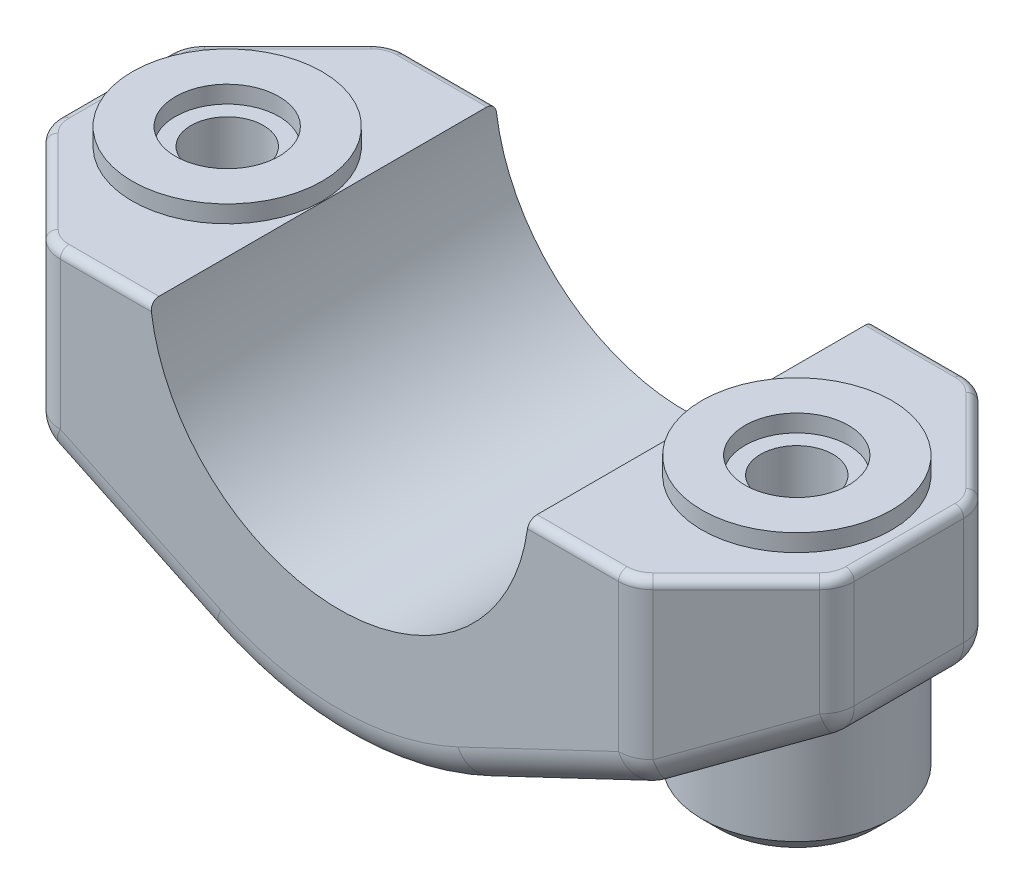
ISO-10303-21;
HEADER;
FILE_DESCRIPTION(('STEP AP214'),'2;1');
FILE_NAME('part.step','',(''),(''),'','','');
FILE_SCHEMA(('AUTOMOTIVE_DESIGN { 1 0 10303 214 1 1 1 1 }'));
ENDSEC;
DATA;
#1=APPLICATION_CONTEXT('core data for automotive mechanical design processes');
#2=APPLICATION_PROTOCOL_DEFINITION('international standard','automotive_design',2000,#1);
#3=PRODUCT_CONTEXT('',#1,'mechanical');
#4=PRODUCT('Part','Part','',(#3));
#5=PRODUCT_RELATED_PRODUCT_CATEGORY('part','',(#4));
#6=PRODUCT_DEFINITION_FORMATION('','',#4);
#7=PRODUCT_DEFINITION_CONTEXT('part definition',#1,'design');
#8=PRODUCT_DEFINITION('design','',#6,#7);
#9=PRODUCT_DEFINITION_SHAPE('','',#8);
#10=(LENGTH_UNIT() NAMED_UNIT(*) SI_UNIT(.MILLI.,.METRE.));
#11=(NAMED_UNIT(*) PLANE_ANGLE_UNIT() SI_UNIT($,.RADIAN.));
#12=(NAMED_UNIT(*) SI_UNIT($,.STERADIAN.) SOLID_ANGLE_UNIT());
#13=UNCERTAINTY_MEASURE_WITH_UNIT(LENGTH_MEASURE(1.E-05),#10,'distance_accuracy_value','');
#14=(GEOMETRIC_REPRESENTATION_CONTEXT(3) GLOBAL_UNCERTAINTY_ASSIGNED_CONTEXT((#13)) GLOBAL_UNIT_ASSIGNED_CONTEXT((#10,
#11,#12)) REPRESENTATION_CONTEXT('',''));
#15=CARTESIAN_POINT('',(0.,0.,0.));
#16=DIRECTION('',(0.,0.,1.));
#17=DIRECTION('',(1.,0.,0.));
#18=AXIS2_PLACEMENT_3D('',#15,#16,#17);
#19=CARTESIAN_POINT('',(23.,-0.999999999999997,10.));
#20=DIRECTION('',(0.,-1.,0.));
#21=DIRECTION('',(1.,0.,0.));
#22=AXIS2_PLACEMENT_3D('',#19,#20,#21);
#23=PLANE('',#22);
#24=DIRECTION('',(0.,0.,-1.));
#25=VECTOR('',#24,1.);
#26=CARTESIAN_POINT('',(10.9544511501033,-1.00000000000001,10.));
#27=LINE('',#26,#25);
#28=CARTESIAN_POINT('',(10.9544511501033,-1.00000000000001,9.50000000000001));
#29=VERTEX_POINT('',#28);
#30=CARTESIAN_POINT('',(10.9544511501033,-1.00000000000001,-9.50000000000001));
#31=VERTEX_POINT('',#30);
#32=EDGE_CURVE('E489',#29,#31,#27,.T.);
#33=ORIENTED_EDGE('',*,*,#32,.F.);
#34=DIRECTION('',(-1.,0.,0.));
#35=VECTOR('',#34,1.);
#36=CARTESIAN_POINT('',(16.1715728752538,-1.,9.50000000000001));
#37=LINE('',#36,#35);
#38=CARTESIAN_POINT('',(16.1715728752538,-1.,9.50000000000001));
#39=VERTEX_POINT('',#38);
#40=EDGE_CURVE('E1514',#29,#39,#37,.F.);
#41=ORIENTED_EDGE('',*,*,#40,.T.);
#42=CARTESIAN_POINT('',(16.1715728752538,-1.,8.00000000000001));
#43=DIRECTION('',(0.,-1.,0.));
#44=DIRECTION('',(1.,0.,0.));
#45=AXIS2_PLACEMENT_3D('',#42,#43,#44);
#46=CIRCLE('',#45,1.5);
#47=CARTESIAN_POINT('',(17.2322330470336,-0.999999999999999,9.06066017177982));
#48=VERTEX_POINT('',#47);
#49=EDGE_CURVE('E686',#39,#48,#46,.F.);
#50=ORIENTED_EDGE('',*,*,#49,.T.);
#51=DIRECTION('',(0.707106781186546,0.,-0.707106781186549));
#52=VECTOR('',#51,1.);
#53=CARTESIAN_POINT('',(22.0606601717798,-0.999999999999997,4.23223304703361));
#54=LINE('',#53,#52);
#55=CARTESIAN_POINT('',(22.0606601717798,-0.999999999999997,4.23223304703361));
#56=VERTEX_POINT('',#55);
#57=EDGE_CURVE('E1498',#48,#56,#54,.T.);
#58=ORIENTED_EDGE('',*,*,#57,.T.);
#59=CARTESIAN_POINT('',(21.,-0.999999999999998,3.17157287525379));
#60=DIRECTION('',(0.,-1.,0.));
#61=DIRECTION('',(1.,0.,0.));
#62=AXIS2_PLACEMENT_3D('',#59,#60,#61);
#63=CIRCLE('',#62,1.5);
#64=CARTESIAN_POINT('',(22.5,-0.999999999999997,3.17157287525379));
#65=VERTEX_POINT('',#64);
#66=EDGE_CURVE('E1503',#56,#65,#63,.F.);
#67=ORIENTED_EDGE('',*,*,#66,.T.);
#68=DIRECTION('',(0.,0.,-1.));
#69=VECTOR('',#68,1.);
#70=CARTESIAN_POINT('',(22.5,-0.999999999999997,10.));
#71=LINE('',#70,#69);
#72=CARTESIAN_POINT('',(22.5,-0.999999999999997,-3.17157287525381));
#73=VERTEX_POINT('',#72);
#74=EDGE_CURVE('E1506',#65,#73,#71,.T.);
#75=ORIENTED_EDGE('',*,*,#74,.T.);
#76=CARTESIAN_POINT('',(21.,-0.999999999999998,-3.17157287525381));
#77=DIRECTION('',(0.,-1.,0.));
#78=DIRECTION('',(1.,0.,0.));
#79=AXIS2_PLACEMENT_3D('',#76,#77,#78);
#80=CIRCLE('',#79,1.5);
#81=CARTESIAN_POINT('',(22.0606601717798,-0.999999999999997,-4.23223304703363));
#82=VERTEX_POINT('',#81);
#83=EDGE_CURVE('E1509',#73,#82,#80,.F.);
#84=ORIENTED_EDGE('',*,*,#83,.T.);
#85=DIRECTION('',(0.707106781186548,0.,0.707106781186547));
#86=VECTOR('',#85,1.);
#87=CARTESIAN_POINT('',(17.2322330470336,-0.999999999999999,-9.06066017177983));
#88=LINE('',#87,#86);
#89=CARTESIAN_POINT('',(17.2322330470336,-0.999999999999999,-9.06066017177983));
#90=VERTEX_POINT('',#89);
#91=EDGE_CURVE('E1616',#82,#90,#88,.F.);
#92=ORIENTED_EDGE('',*,*,#91,.T.);
#93=CARTESIAN_POINT('',(16.1715728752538,-1.,-8.00000000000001));
#94=DIRECTION('',(0.,-1.,0.));
#95=DIRECTION('',(1.,0.,0.));
#96=AXIS2_PLACEMENT_3D('',#93,#94,#95);
#97=CIRCLE('',#96,1.5);
#98=CARTESIAN_POINT('',(16.1715728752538,-1.,-9.50000000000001));
#99=VERTEX_POINT('',#98);
#100=EDGE_CURVE('E1620',#90,#99,#97,.F.);
#101=ORIENTED_EDGE('',*,*,#100,.T.);
#102=DIRECTION('',(-1.,0.,0.));
#103=VECTOR('',#102,1.);
#104=CARTESIAN_POINT('',(23.,-0.999999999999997,-9.50000000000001));
#105=LINE('',#104,#103);
#106=EDGE_CURVE('E1590',#99,#31,#105,.T.);
#107=ORIENTED_EDGE('',*,*,#106,.T.);
#108=EDGE_LOOP('',(#33,#41,#50,#58,#67,#75,#84,#92,#101,#107));
#109=FACE_BOUND('',#108,.T.);
#110=CARTESIAN_POINT('',(16.5,-0.999999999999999,0.));
#111=DIRECTION('',(0.,-1.,0.));
#112=DIRECTION('',(1.,0.,0.));
#113=AXIS2_PLACEMENT_3D('',#110,#111,#112);
#114=CIRCLE('',#113,5.5);
#115=CARTESIAN_POINT('',(22.,-0.999999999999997,0.));
#116=VERTEX_POINT('',#115);
#117=EDGE_CURVE('E11',#116,#116,#114,.F.);
#118=ORIENTED_EDGE('',*,*,#117,.F.);
#119=EDGE_LOOP('',(#118));
#120=FACE_BOUND('',#119,.T.);
#121=ADVANCED_FACE('F37',(#109,#120),#23,.F.);
#122=CARTESIAN_POINT('',(-10.9544511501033,-1.,10.));
#123=DIRECTION('',(0.,-1.,0.));
#124=DIRECTION('',(1.,0.,0.));
#125=AXIS2_PLACEMENT_3D('',#122,#123,#124);
#126=PLANE('',#125);
#127=DIRECTION('',(0.,0.,-1.));
#128=VECTOR('',#127,1.);
#129=CARTESIAN_POINT('',(-10.9544511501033,-1.,10.));
#130=LINE('',#129,#128);
#131=CARTESIAN_POINT('',(-10.9544511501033,-1.,9.50000000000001));
#132=VERTEX_POINT('',#131);
#133=CARTESIAN_POINT('',(-10.9544511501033,-1.,-9.50000000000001));
#134=VERTEX_POINT('',#133);
#135=EDGE_CURVE('E486',#132,#134,#130,.T.);
#136=ORIENTED_EDGE('',*,*,#135,.T.);
#137=DIRECTION('',(-1.,0.,0.));
#138=VECTOR('',#137,1.);
#139=CARTESIAN_POINT('',(-10.9544511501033,-1.,-9.50000000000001));
#140=LINE('',#139,#138);
#141=CARTESIAN_POINT('',(-16.1715728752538,-1.,-9.50000000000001));
#142=VERTEX_POINT('',#141);
#143=EDGE_CURVE('E1542',#134,#142,#140,.T.);
#144=ORIENTED_EDGE('',*,*,#143,.T.);
#145=CARTESIAN_POINT('',(-16.1715728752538,-1.,-8.00000000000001));
#146=DIRECTION('',(0.,-1.,0.));
#147=DIRECTION('',(1.,0.,0.));
#148=AXIS2_PLACEMENT_3D('',#145,#146,#147);
#149=CIRCLE('',#148,1.5);
#150=CARTESIAN_POINT('',(-17.2322330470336,-1.,-9.06066017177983));
#151=VERTEX_POINT('',#150);
#152=EDGE_CURVE('E1540',#142,#151,#149,.F.);
#153=ORIENTED_EDGE('',*,*,#152,.T.);
#154=DIRECTION('',(0.707106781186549,0.,-0.707106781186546));
#155=VECTOR('',#154,1.);
#156=CARTESIAN_POINT('',(-22.0606601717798,-1.,-4.23223304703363));
#157=LINE('',#156,#155);
#158=CARTESIAN_POINT('',(-22.0606601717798,-1.,-4.23223304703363));
#159=VERTEX_POINT('',#158);
#160=EDGE_CURVE('E1527',#151,#159,#157,.F.);
#161=ORIENTED_EDGE('',*,*,#160,.T.);
#162=CARTESIAN_POINT('',(-21.,-1.,-3.1715728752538));
#163=DIRECTION('',(0.,-1.,0.));
#164=DIRECTION('',(1.,0.,0.));
#165=AXIS2_PLACEMENT_3D('',#162,#163,#164);
#166=CIRCLE('',#165,1.5);
#167=CARTESIAN_POINT('',(-22.5,-1.,-3.1715728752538));
#168=VERTEX_POINT('',#167);
#169=EDGE_CURVE('E1529',#159,#168,#166,.F.);
#170=ORIENTED_EDGE('',*,*,#169,.T.);
#171=DIRECTION('',(0.,0.,-1.));
#172=VECTOR('',#171,1.);
#173=CARTESIAN_POINT('',(-22.5,-1.,10.));
#174=LINE('',#173,#172);
#175=CARTESIAN_POINT('',(-22.5,-1.,3.1715728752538));
#176=VERTEX_POINT('',#175);
#177=EDGE_CURVE('E763',#168,#176,#174,.F.);
#178=ORIENTED_EDGE('',*,*,#177,.T.);
#179=CARTESIAN_POINT('',(-21.,-1.,3.1715728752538));
#180=DIRECTION('',(0.,-1.,0.));
#181=DIRECTION('',(1.,0.,0.));
#182=AXIS2_PLACEMENT_3D('',#179,#180,#181);
#183=CIRCLE('',#182,1.5);
#184=CARTESIAN_POINT('',(-22.0606601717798,-1.,4.23223304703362));
#185=VERTEX_POINT('',#184);
#186=EDGE_CURVE('E1532',#176,#185,#183,.F.);
#187=ORIENTED_EDGE('',*,*,#186,.T.);
#188=DIRECTION('',(0.707106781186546,0.,0.707106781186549));
#189=VECTOR('',#188,1.);
#190=CARTESIAN_POINT('',(-17.2322330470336,-1.,9.06066017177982));
#191=LINE('',#190,#189);
#192=CARTESIAN_POINT('',(-17.2322330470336,-1.,9.06066017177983));
#193=VERTEX_POINT('',#192);
#194=EDGE_CURVE('E1534',#185,#193,#191,.T.);
#195=ORIENTED_EDGE('',*,*,#194,.T.);
#196=CARTESIAN_POINT('',(-16.1715728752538,-1.,8.00000000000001));
#197=DIRECTION('',(0.,-1.,0.));
#198=DIRECTION('',(1.,0.,0.));
#199=AXIS2_PLACEMENT_3D('',#196,#197,#198);
#200=CIRCLE('',#199,1.5);
#201=CARTESIAN_POINT('',(-16.1715728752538,-1.,9.50000000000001));
#202=VERTEX_POINT('',#201);
#203=EDGE_CURVE('E1536',#193,#202,#200,.F.);
#204=ORIENTED_EDGE('',*,*,#203,.T.);
#205=DIRECTION('',(-1.,0.,0.));
#206=VECTOR('',#205,1.);
#207=CARTESIAN_POINT('',(-10.9544511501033,-1.,9.50000000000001));
#208=LINE('',#207,#206);
#209=EDGE_CURVE('E1538',#202,#132,#208,.F.);
#210=ORIENTED_EDGE('',*,*,#209,.T.);
#211=EDGE_LOOP('',(#136,#144,#153,#161,#170,#178,#187,#195,#204,#210));
#212=FACE_BOUND('',#211,.T.);
#213=CARTESIAN_POINT('',(-16.5,-1.,0.));
#214=DIRECTION('',(0.,-1.,0.));
#215=DIRECTION('',(1.,0.,0.));
#216=AXIS2_PLACEMENT_3D('',#213,#214,#215);
#217=CIRCLE('',#216,5.5);
#218=CARTESIAN_POINT('',(-11.,-1.,0.));
#219=VERTEX_POINT('',#218);
#220=EDGE_CURVE('E46',#219,#219,#217,.F.);
#221=ORIENTED_EDGE('',*,*,#220,.F.);
#222=EDGE_LOOP('',(#221));
#223=FACE_BOUND('',#222,.T.);
#224=ADVANCED_FACE('F366',(#212,#223),#126,.F.);
#225=CARTESIAN_POINT('',(0.,0.,10.));
#226=DIRECTION('',(0.,0.,-1.));
#227=DIRECTION('',(-1.,0.,0.));
#228=AXIS2_PLACEMENT_3D('',#225,#226,#227);
#229=CYLINDRICAL_SURFACE('',#228,18.);
#230=DIRECTION('',(0.,0.,-1.));
#231=VECTOR('',#230,1.);
#232=CARTESIAN_POINT('',(7.72513345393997,-16.2579922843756,10.));
#233=LINE('',#232,#231);
#234=CARTESIAN_POINT('',(7.72513345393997,-16.2579922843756,8.00000000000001));
#235=VERTEX_POINT('',#234);
#236=CARTESIAN_POINT('',(7.72513345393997,-16.2579922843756,-8.));
#237=VERTEX_POINT('',#236);
#238=EDGE_CURVE('E492',#235,#237,#233,.T.);
#239=ORIENTED_EDGE('',*,*,#238,.F.);
#240=CARTESIAN_POINT('',(0.,0.,8.00000000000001));
#241=DIRECTION('',(0.,0.,1.));
#242=DIRECTION('',(1.,0.,0.));
#243=AXIS2_PLACEMENT_3D('',#240,#241,#242);
#244=CIRCLE('',#243,18.);
#245=CARTESIAN_POINT('',(-7.72513345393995,-16.2579922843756,8.00000000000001));
#246=VERTEX_POINT('',#245);
#247=EDGE_CURVE('E572',#235,#246,#244,.F.);
#248=ORIENTED_EDGE('',*,*,#247,.T.);
#249=DIRECTION('',(0.,0.,-1.));
#250=VECTOR('',#249,1.);
#251=CARTESIAN_POINT('',(-7.72513345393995,-16.2579922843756,10.));
#252=LINE('',#251,#250);
#253=CARTESIAN_POINT('',(-7.72513345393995,-16.2579922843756,-8.));
#254=VERTEX_POINT('',#253);
#255=EDGE_CURVE('E479',#246,#254,#252,.T.);
#256=ORIENTED_EDGE('',*,*,#255,.T.);
#257=CARTESIAN_POINT('',(0.,0.,-8.));
#258=DIRECTION('',(0.,0.,1.));
#259=DIRECTION('',(1.,0.,0.));
#260=AXIS2_PLACEMENT_3D('',#257,#258,#259);
#261=CIRCLE('',#260,18.);
#262=EDGE_CURVE('E570',#254,#237,#261,.T.);
#263=ORIENTED_EDGE('',*,*,#262,.T.);
#264=EDGE_LOOP('',(#239,#248,#256,#263));
#265=FACE_BOUND('',#264,.T.);
#266=ADVANCED_FACE('F448',(#265),#229,.T.);
#267=CARTESIAN_POINT('',(7.72513345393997,-16.2579922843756,10.));
#268=DIRECTION('',(-0.429174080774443,0.903221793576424,0.));
#269=DIRECTION('',(-0.903221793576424,-0.429174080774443,0.));
#270=AXIS2_PLACEMENT_3D('',#267,#268,#269);
#271=PLANE('',#270);
#272=DIRECTION('',(0.,0.,-1.));
#273=VECTOR('',#272,1.);
#274=CARTESIAN_POINT('',(21.8583481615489,-9.54246629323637,10.));
#275=LINE('',#274,#273);
#276=CARTESIAN_POINT('',(21.8583481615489,-9.54246629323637,-3.17157287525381));
#277=VERTEX_POINT('',#276);
#278=CARTESIAN_POINT('',(21.8583481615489,-9.54246629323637,-1.24020360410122));
#279=VERTEX_POINT('',#278);
#280=EDGE_CURVE('E296',#277,#279,#275,.F.);
#281=ORIENTED_EDGE('',*,*,#280,.T.);
#282=CARTESIAN_POINT('',(16.5,-12.0885343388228,0.));
#283=DIRECTION('',(-0.429174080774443,0.903221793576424,0.));
#284=DIRECTION('',(0.903221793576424,0.429174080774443,0.));
#285=AXIS2_PLACEMENT_3D('',#282,#283,#284);
#286=ELLIPSE('',#285,6.08931276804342,5.5);
#287=CARTESIAN_POINT('',(21.8583481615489,-9.5424662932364,1.24020360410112));
#288=VERTEX_POINT('',#287);
#289=EDGE_CURVE('E300',#279,#288,#286,.T.);
#290=ORIENTED_EDGE('',*,*,#289,.T.);
#291=CARTESIAN_POINT('',(21.8583481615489,-9.54246629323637,3.17157287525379));
#292=VERTEX_POINT('',#291);
#293=EDGE_CURVE('E284',#288,#292,#275,.F.);
#294=ORIENTED_EDGE('',*,*,#293,.T.);
#295=DIRECTION('',(-0.67028461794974,-0.318491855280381,0.670284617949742));
#296=VECTOR('',#295,1.);
#297=CARTESIAN_POINT('',(16.7006664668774,-11.9931858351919,8.32925456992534));
#298=LINE('',#297,#296);
#299=CARTESIAN_POINT('',(17.0299210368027,-11.8367375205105,8.00000000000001));
#300=VERTEX_POINT('',#299);
#301=EDGE_CURVE('E577',#292,#300,#298,.T.);
#302=ORIENTED_EDGE('',*,*,#301,.T.);
#303=DIRECTION('',(0.903221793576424,0.429174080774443,0.));
#304=VECTOR('',#303,1.);
#305=CARTESIAN_POINT('',(7.72513345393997,-16.2579922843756,8.00000000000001));
#306=LINE('',#305,#304);
#307=EDGE_CURVE('E579',#300,#235,#306,.F.);
#308=ORIENTED_EDGE('',*,*,#307,.T.);
#309=ORIENTED_EDGE('',*,*,#238,.T.);
#310=DIRECTION('',(0.903221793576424,0.429174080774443,0.));
#311=VECTOR('',#310,1.);
#312=CARTESIAN_POINT('',(7.72513345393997,-16.2579922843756,-8.));
#313=LINE('',#312,#311);
#314=CARTESIAN_POINT('',(17.0299210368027,-11.8367375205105,-8.));
#315=VERTEX_POINT('',#314);
#316=EDGE_CURVE('E574',#237,#315,#313,.T.);
#317=ORIENTED_EDGE('',*,*,#316,.T.);
#318=DIRECTION('',(-0.670284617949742,-0.318491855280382,-0.67028461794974));
#319=VECTOR('',#318,1.);
#320=CARTESIAN_POINT('',(21.5290935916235,-9.69891460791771,-3.50082744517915));
#321=LINE('',#320,#319);
#322=EDGE_CURVE('E297',#315,#277,#321,.F.);
#323=ORIENTED_EDGE('',*,*,#322,.T.);
#324=EDGE_LOOP('',(#281,#290,#294,#302,#308,#309,#317,#323));
#325=FACE_BOUND('',#324,.T.);
#326=ADVANCED_FACE('F301',(#325),#271,.F.);
#327=CARTESIAN_POINT('',(23.,-9.,10.));
#328=DIRECTION('',(-1.,0.,0.));
#329=DIRECTION('',(0.,-1.,0.));
#330=AXIS2_PLACEMENT_3D('',#327,#328,#329);
#331=PLANE('',#330);
#332=DIRECTION('',(0.,-1.,0.));
#333=VECTOR('',#332,1.);
#334=CARTESIAN_POINT('',(23.,-0.999999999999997,-3.17157287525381));
#335=LINE('',#334,#333);
#336=CARTESIAN_POINT('',(23.,-7.73602270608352,-3.17157287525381));
#337=VERTEX_POINT('',#336);
#338=CARTESIAN_POINT('',(23.,-1.5,-3.17157287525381));
#339=VERTEX_POINT('',#338);
#340=EDGE_CURVE('E507',#337,#339,#335,.F.);
#341=ORIENTED_EDGE('',*,*,#340,.T.);
#342=DIRECTION('',(0.,0.,-1.));
#343=VECTOR('',#342,1.);
#344=CARTESIAN_POINT('',(23.,-1.5,10.));
#345=LINE('',#344,#343);
#346=CARTESIAN_POINT('',(23.,-1.5,3.17157287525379));
#347=VERTEX_POINT('',#346);
#348=EDGE_CURVE('E1519',#339,#347,#345,.F.);
#349=ORIENTED_EDGE('',*,*,#348,.T.);
#350=DIRECTION('',(0.,-1.,0.));
#351=VECTOR('',#350,1.);
#352=CARTESIAN_POINT('',(23.,-9.,3.17157287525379));
#353=LINE('',#352,#351);
#354=CARTESIAN_POINT('',(23.,-7.73602270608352,3.17157287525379));
#355=VERTEX_POINT('',#354);
#356=EDGE_CURVE('E505',#347,#355,#353,.T.);
#357=ORIENTED_EDGE('',*,*,#356,.T.);
#358=DIRECTION('',(0.,0.,-1.));
#359=VECTOR('',#358,1.);
#360=CARTESIAN_POINT('',(23.,-7.73602270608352,10.));
#361=LINE('',#360,#359);
#362=EDGE_CURVE('E589',#355,#337,#361,.T.);
#363=ORIENTED_EDGE('',*,*,#362,.T.);
#364=EDGE_LOOP('',(#341,#349,#357,#363));
#365=FACE_BOUND('',#364,.T.);
#366=ADVANCED_FACE('F453',(#365),#331,.F.);
#367=CARTESIAN_POINT('',(16.5,-0.999999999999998,0.));
#368=DIRECTION('',(0.,1.,0.));
#369=DIRECTION('',(-1.,0.,0.));
#370=AXIS2_PLACEMENT_3D('',#367,#368,#369);
#371=CIRCLE('',#370,3.);
#372=CARTESIAN_POINT('',(13.5,-0.999999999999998,0.));
#373=VERTEX_POINT('',#372);
#374=EDGE_CURVE('E462',#373,#373,#371,.T.);
#375=ORIENTED_EDGE('',*,*,#374,.T.);
#376=EDGE_LOOP('',(#375));
#377=FACE_BOUND('',#376,.T.);
#378=CARTESIAN_POINT('',(16.5,-0.99999999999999,0.));
#379=DIRECTION('',(0.,-1.,0.));
#380=DIRECTION('',(0.,0.,-1.));
#381=AXIS2_PLACEMENT_3D('',#378,#379,#380);
#382=CIRCLE('',#381,2.1);
#383=CARTESIAN_POINT('',(16.5,-0.99999999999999,-2.1));
#384=VERTEX_POINT('',#383);
#385=EDGE_CURVE('E304',#384,#384,#382,.T.);
#386=ORIENTED_EDGE('',*,*,#385,.T.);
#387=EDGE_LOOP('',(#386));
#388=FACE_BOUND('',#387,.T.);
#389=ADVANCED_FACE('F370',(#377,#388),#23,.F.);
#390=CARTESIAN_POINT('',(0.,0.,10.));
#391=DIRECTION('',(0.,0.,-1.));
#392=DIRECTION('',(-1.,0.,0.));
#393=AXIS2_PLACEMENT_3D('',#390,#391,#392);
#394=CYLINDRICAL_SURFACE('',#393,11.);
#395=CARTESIAN_POINT('',(0.,0.,10.));
#396=DIRECTION('',(0.,0.,-1.));
#397=DIRECTION('',(1.,0.,0.));
#398=AXIS2_PLACEMENT_3D('',#395,#396,#397);
#399=CIRCLE('',#398,11.);
#400=CARTESIAN_POINT('',(10.8972473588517,-1.5,10.));
#401=VERTEX_POINT('',#400);
#402=CARTESIAN_POINT('',(-10.8972473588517,-1.5,10.));
#403=VERTEX_POINT('',#402);
#404=EDGE_CURVE('E476',#401,#403,#399,.T.);
#405=ORIENTED_EDGE('',*,*,#404,.F.);
#406=CARTESIAN_POINT('',(10.8972473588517,-1.5,10.));
#407=CARTESIAN_POINT('',(10.9011320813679,-1.4718094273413,10.0000237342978));
#408=CARTESIAN_POINT('',(10.9048985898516,-1.44360616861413,9.9976171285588));
#409=CARTESIAN_POINT('',(10.9121162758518,-1.38797684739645,9.98809871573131));
#410=CARTESIAN_POINT('',(10.9155675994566,-1.36055042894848,9.98098910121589));
#411=CARTESIAN_POINT('',(10.9220819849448,-1.3072315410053,9.96221351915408));
#412=CARTESIAN_POINT('',(10.925144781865,-1.28134012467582,9.95054446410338));
#413=CARTESIAN_POINT('',(10.9308328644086,-1.23187318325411,9.92297640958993));
#414=CARTESIAN_POINT('',(10.9334582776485,-1.20829698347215,9.9070786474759));
#415=CARTESIAN_POINT('',(10.9382333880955,-1.16427623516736,9.87159693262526));
#416=CARTESIAN_POINT('',(10.9403857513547,-1.14381434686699,9.85203485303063));
#417=CARTESIAN_POINT('',(10.9442270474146,-1.10645733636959,9.80971090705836));
#418=CARTESIAN_POINT('',(10.9459158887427,-1.08956291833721,9.78694841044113));
#419=CARTESIAN_POINT('',(10.9488246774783,-1.05993365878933,9.73902112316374));
#420=CARTESIAN_POINT('',(10.9500473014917,-1.0471751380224,9.71387111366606));
#421=CARTESIAN_POINT('',(10.9520458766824,-1.02606252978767,9.66177710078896));
#422=CARTESIAN_POINT('',(10.9528221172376,-1.01770558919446,9.63483427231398));
#423=CARTESIAN_POINT('',(10.9537378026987,-1.0077912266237,9.58976209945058));
#424=CARTESIAN_POINT('',(10.9540056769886,-1.00487121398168,9.57192327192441));
#425=CARTESIAN_POINT('',(10.9543620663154,-1.00097595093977,9.53605885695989));
#426=CARTESIAN_POINT('',(10.9544508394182,-0.999997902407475,9.51803357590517));
#427=CARTESIAN_POINT('',(10.9544511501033,-1.,9.50000000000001));
#428=B_SPLINE_CURVE_WITH_KNOTS('',3,(#406,#407,#408,#409,#410,#411,#412,#413,#414,#415,#416,
#417,#418,#419,#420,#421,#422,#423,#424,#425,#426,#427),.UNSPECIFIED.,.F.,.F.,(4,2,2,2,2,2,2,2,
2,2,4),(0.,0.0852642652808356,0.170488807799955,0.255771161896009,0.341028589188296,
0.425792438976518,0.510573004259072,0.59485923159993,0.679090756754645,0.73322664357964,
0.787284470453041),.UNSPECIFIED.);
#429=EDGE_CURVE('E395',#401,#29,#428,.T.);
#430=ORIENTED_EDGE('',*,*,#429,.T.);
#431=ORIENTED_EDGE('',*,*,#32,.T.);
#432=CARTESIAN_POINT('',(10.9544511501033,-1.,-9.50000000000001));
#433=CARTESIAN_POINT('',(10.9544503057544,-0.999975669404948,-9.52803148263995));
#434=CARTESIAN_POINT('',(10.9542360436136,-1.00235582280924,-9.55605546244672));
#435=CARTESIAN_POINT('',(10.9533744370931,-1.0117452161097,-9.61128625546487));
#436=CARTESIAN_POINT('',(10.9527274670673,-1.01875045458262,-9.6384937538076));
#437=CARTESIAN_POINT('',(10.950993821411,-1.03721494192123,-9.69135267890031));
#438=CARTESIAN_POINT('',(10.9499069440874,-1.04867623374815,-9.71700338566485));
#439=CARTESIAN_POINT('',(10.9472843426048,-1.07570927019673,-9.76600722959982));
#440=CARTESIAN_POINT('',(10.9457486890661,-1.0912803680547,-9.78936072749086));
#441=CARTESIAN_POINT('',(10.942220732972,-1.1261042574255,-9.83314483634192));
#442=CARTESIAN_POINT('',(10.9402278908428,-1.14536139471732,-9.85357194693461));
#443=CARTESIAN_POINT('',(10.9357893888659,-1.18699106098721,-9.8909055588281));
#444=CARTESIAN_POINT('',(10.9333436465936,-1.20936415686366,-9.90781141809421));
#445=CARTESIAN_POINT('',(10.9280072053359,-1.25667293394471,-9.93769649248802));
#446=CARTESIAN_POINT('',(10.9251147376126,-1.28161866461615,-9.95065946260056));
#447=CARTESIAN_POINT('',(10.918930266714,-1.33328054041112,-9.97221505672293));
#448=CARTESIAN_POINT('',(10.9156384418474,-1.3599958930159,-9.98080962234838));
#449=CARTESIAN_POINT('',(10.9098267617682,-1.4057128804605,-9.99139753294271));
#450=CARTESIAN_POINT('',(10.9073965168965,-1.42445036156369,-9.99462281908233));
#451=CARTESIAN_POINT('',(10.902410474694,-1.46212528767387,-9.99892381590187));
#452=CARTESIAN_POINT('',(10.8998548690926,-1.48106239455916,-10.0000027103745));
#453=CARTESIAN_POINT('',(10.8972473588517,-1.5,-10.));
#454=B_SPLINE_CURVE_WITH_KNOTS('',3,(#432,#433,#434,#435,#436,#437,#438,#439,#440,#441,#442,
#443,#444,#445,#446,#447,#448,#449,#450,#451,#452,#453),.UNSPECIFIED.,.F.,.F.,(4,2,2,2,2,2,2,2,
2,2,4),(0.,0.0839819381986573,0.167891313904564,0.251839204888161,0.335773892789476,
0.419808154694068,0.503857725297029,0.588249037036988,0.672602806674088,0.729991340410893,
0.787294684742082),.UNSPECIFIED.);
#455=CARTESIAN_POINT('',(10.8972473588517,-1.5,-10.));
#456=VERTEX_POINT('',#455);
#457=EDGE_CURVE('E376',#31,#456,#454,.T.);
#458=ORIENTED_EDGE('',*,*,#457,.T.);
#459=CARTESIAN_POINT('',(0.,0.,-10.));
#460=DIRECTION('',(0.,0.,-1.));
#461=DIRECTION('',(1.,0.,0.));
#462=AXIS2_PLACEMENT_3D('',#459,#460,#461);
#463=CIRCLE('',#462,11.);
#464=CARTESIAN_POINT('',(-10.8972473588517,-1.5,-10.));
#465=VERTEX_POINT('',#464);
#466=EDGE_CURVE('E480',#456,#465,#463,.T.);
#467=ORIENTED_EDGE('',*,*,#466,.T.);
#468=CARTESIAN_POINT('',(-10.8972473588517,-1.5,-10.));
#469=CARTESIAN_POINT('',(-10.9011320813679,-1.4718094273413,-10.0000237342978));
#470=CARTESIAN_POINT('',(-10.9048985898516,-1.44360616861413,-9.9976171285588));
#471=CARTESIAN_POINT('',(-10.9121162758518,-1.38797684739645,-9.98809871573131));
#472=CARTESIAN_POINT('',(-10.9155675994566,-1.36055042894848,-9.98098910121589));
#473=CARTESIAN_POINT('',(-10.9220819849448,-1.3072315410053,-9.96221351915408));
#474=CARTESIAN_POINT('',(-10.925144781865,-1.28134012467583,-9.95054446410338));
#475=CARTESIAN_POINT('',(-10.9308328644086,-1.23187318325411,-9.92297640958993));
#476=CARTESIAN_POINT('',(-10.9334582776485,-1.20829698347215,-9.9070786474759));
#477=CARTESIAN_POINT('',(-10.9382333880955,-1.16427623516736,-9.87159693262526));
#478=CARTESIAN_POINT('',(-10.9403857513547,-1.14381434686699,-9.85203485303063));
#479=CARTESIAN_POINT('',(-10.9442270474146,-1.10645733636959,-9.80971090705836));
#480=CARTESIAN_POINT('',(-10.9459158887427,-1.08956291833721,-9.78694841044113));
#481=CARTESIAN_POINT('',(-10.9488246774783,-1.05993365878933,-9.73902112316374));
#482=CARTESIAN_POINT('',(-10.9500473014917,-1.04717513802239,-9.71387111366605));
#483=CARTESIAN_POINT('',(-10.9520458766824,-1.02606252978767,-9.66177710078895));
#484=CARTESIAN_POINT('',(-10.9528221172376,-1.01770558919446,-9.63483427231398));
#485=CARTESIAN_POINT('',(-10.9537378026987,-1.0077912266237,-9.58976209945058));
#486=CARTESIAN_POINT('',(-10.9540056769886,-1.00487121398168,-9.57192327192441));
#487=CARTESIAN_POINT('',(-10.9543620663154,-1.00097595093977,-9.53605885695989));
#488=CARTESIAN_POINT('',(-10.9544508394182,-0.999997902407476,-9.51803357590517));
#489=CARTESIAN_POINT('',(-10.9544511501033,-1.,-9.50000000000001));
#490=B_SPLINE_CURVE_WITH_KNOTS('',3,(#468,#469,#470,#471,#472,#473,#474,#475,#476,#477,#478,
#479,#480,#481,#482,#483,#484,#485,#486,#487,#488,#489),.UNSPECIFIED.,.F.,.F.,(4,2,2,2,2,2,2,2,
2,2,4),(0.,0.0852642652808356,0.170488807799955,0.255771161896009,0.341028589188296,
0.425792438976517,0.510573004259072,0.594859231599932,0.679090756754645,0.733226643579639,
0.787284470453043),.UNSPECIFIED.);
#491=EDGE_CURVE('E390',#465,#134,#490,.T.);
#492=ORIENTED_EDGE('',*,*,#491,.T.);
#493=ORIENTED_EDGE('',*,*,#135,.F.);
#494=CARTESIAN_POINT('',(-10.9544511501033,-1.,9.50000000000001));
#495=CARTESIAN_POINT('',(-10.9544503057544,-0.999975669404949,9.52803148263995));
#496=CARTESIAN_POINT('',(-10.9542360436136,-1.00235582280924,9.55605546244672));
#497=CARTESIAN_POINT('',(-10.9533744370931,-1.0117452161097,9.61128625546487));
#498=CARTESIAN_POINT('',(-10.9527274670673,-1.01875045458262,9.6384937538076));
#499=CARTESIAN_POINT('',(-10.950993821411,-1.03721494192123,9.69135267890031));
#500=CARTESIAN_POINT('',(-10.9499069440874,-1.04867623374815,9.71700338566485));
#501=CARTESIAN_POINT('',(-10.9472843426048,-1.07570927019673,9.76600722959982));
#502=CARTESIAN_POINT('',(-10.9457486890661,-1.0912803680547,9.78936072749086));
#503=CARTESIAN_POINT('',(-10.942220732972,-1.1261042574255,9.83314483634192));
#504=CARTESIAN_POINT('',(-10.9402278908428,-1.14536139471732,9.85357194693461));
#505=CARTESIAN_POINT('',(-10.9357893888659,-1.18699106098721,9.8909055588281));
#506=CARTESIAN_POINT('',(-10.9333436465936,-1.20936415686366,9.90781141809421));
#507=CARTESIAN_POINT('',(-10.9280072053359,-1.25667293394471,9.93769649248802));
#508=CARTESIAN_POINT('',(-10.9251147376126,-1.28161866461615,9.95065946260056));
#509=CARTESIAN_POINT('',(-10.918930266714,-1.33328054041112,9.97221505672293));
#510=CARTESIAN_POINT('',(-10.9156384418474,-1.3599958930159,9.98080962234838));
#511=CARTESIAN_POINT('',(-10.9098267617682,-1.4057128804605,9.99139753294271));
#512=CARTESIAN_POINT('',(-10.9073965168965,-1.42445036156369,9.99462281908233));
#513=CARTESIAN_POINT('',(-10.902410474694,-1.46212528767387,9.99892381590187));
#514=CARTESIAN_POINT('',(-10.8998548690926,-1.48106239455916,10.0000027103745));
#515=CARTESIAN_POINT('',(-10.8972473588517,-1.5,10.));
#516=B_SPLINE_CURVE_WITH_KNOTS('',3,(#494,#495,#496,#497,#498,#499,#500,#501,#502,#503,#504,
#505,#506,#507,#508,#509,#510,#511,#512,#513,#514,#515),.UNSPECIFIED.,.F.,.F.,(4,2,2,2,2,2,2,2,
2,2,4),(0.,0.0839819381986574,0.167891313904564,0.251839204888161,0.335773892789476,
0.419808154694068,0.503857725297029,0.588249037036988,0.672602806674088,0.729991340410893,
0.787294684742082),.UNSPECIFIED.);
#517=EDGE_CURVE('E385',#132,#403,#516,.T.);
#518=ORIENTED_EDGE('',*,*,#517,.T.);
#519=EDGE_LOOP('',(#405,#430,#431,#458,#467,#492,#493,#518));
#520=FACE_BOUND('',#519,.T.);
#521=ADVANCED_FACE('F364',(#520),#394,.F.);
#522=CARTESIAN_POINT('',(-16.5,-1.,0.));
#523=DIRECTION('',(0.,1.,0.));
#524=DIRECTION('',(-1.,0.,0.));
#525=AXIS2_PLACEMENT_3D('',#522,#523,#524);
#526=CIRCLE('',#525,3.);
#527=CARTESIAN_POINT('',(-19.5,-1.,0.));
#528=VERTEX_POINT('',#527);
#529=EDGE_CURVE('E1352',#528,#528,#526,.T.);
#530=ORIENTED_EDGE('',*,*,#529,.T.);
#531=EDGE_LOOP('',(#530));
#532=FACE_BOUND('',#531,.T.);
#533=CARTESIAN_POINT('',(-16.5,-0.999999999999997,0.));
#534=DIRECTION('',(0.,-1.,0.));
#535=DIRECTION('',(0.,0.,-1.));
#536=AXIS2_PLACEMENT_3D('',#533,#534,#535);
#537=CIRCLE('',#536,2.1);
#538=CARTESIAN_POINT('',(-16.5,-0.999999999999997,-2.1));
#539=VERTEX_POINT('',#538);
#540=EDGE_CURVE('E469',#539,#539,#537,.T.);
#541=ORIENTED_EDGE('',*,*,#540,.T.);
#542=EDGE_LOOP('',(#541));
#543=FACE_BOUND('',#542,.T.);
#544=ADVANCED_FACE('F361',(#532,#543),#126,.F.);
#545=CARTESIAN_POINT('',(-23.,-1.,10.));
#546=DIRECTION('',(1.,0.,0.));
#547=DIRECTION('',(0.,1.,0.));
#548=AXIS2_PLACEMENT_3D('',#545,#546,#547);
#549=PLANE('',#548);
#550=DIRECTION('',(0.,1.,0.));
#551=VECTOR('',#550,1.);
#552=CARTESIAN_POINT('',(-23.,-1.,3.1715728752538));
#553=LINE('',#552,#551);
#554=CARTESIAN_POINT('',(-23.,-7.73602270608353,3.1715728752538));
#555=VERTEX_POINT('',#554);
#556=CARTESIAN_POINT('',(-23.,-1.5,3.1715728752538));
#557=VERTEX_POINT('',#556);
#558=EDGE_CURVE('E527',#555,#557,#553,.T.);
#559=ORIENTED_EDGE('',*,*,#558,.T.);
#560=DIRECTION('',(0.,0.,-1.));
#561=VECTOR('',#560,1.);
#562=CARTESIAN_POINT('',(-23.,-1.5,10.));
#563=LINE('',#562,#561);
#564=CARTESIAN_POINT('',(-23.,-1.5,-3.1715728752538));
#565=VERTEX_POINT('',#564);
#566=EDGE_CURVE('E61',#557,#565,#563,.T.);
#567=ORIENTED_EDGE('',*,*,#566,.T.);
#568=DIRECTION('',(0.,1.,0.));
#569=VECTOR('',#568,1.);
#570=CARTESIAN_POINT('',(-23.,-9.00000000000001,-3.1715728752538));
#571=LINE('',#570,#569);
#572=CARTESIAN_POINT('',(-23.,-7.73602270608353,-3.1715728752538));
#573=VERTEX_POINT('',#572);
#574=EDGE_CURVE('E525',#565,#573,#571,.F.);
#575=ORIENTED_EDGE('',*,*,#574,.T.);
#576=DIRECTION('',(0.,0.,-1.));
#577=VECTOR('',#576,1.);
#578=CARTESIAN_POINT('',(-23.,-7.73602270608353,10.));
#579=LINE('',#578,#577);
#580=EDGE_CURVE('E554',#573,#555,#579,.F.);
#581=ORIENTED_EDGE('',*,*,#580,.T.);
#582=EDGE_LOOP('',(#559,#567,#575,#581));
#583=FACE_BOUND('',#582,.T.);
#584=ADVANCED_FACE('F357',(#583),#549,.F.);
#585=CARTESIAN_POINT('',(-23.,-9.00000000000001,10.));
#586=DIRECTION('',(0.429174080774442,0.903221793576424,0.));
#587=DIRECTION('',(-0.903221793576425,0.429174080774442,0.));
#588=AXIS2_PLACEMENT_3D('',#585,#586,#587);
#589=PLANE('',#588);
#590=DIRECTION('',(0.,0.,-1.));
#591=VECTOR('',#590,1.);
#592=CARTESIAN_POINT('',(-21.8583481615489,-9.54246629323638,10.));
#593=LINE('',#592,#591);
#594=CARTESIAN_POINT('',(-21.8583481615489,-9.54246629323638,3.1715728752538));
#595=VERTEX_POINT('',#594);
#596=CARTESIAN_POINT('',(-21.8583481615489,-9.54246629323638,1.24020360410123));
#597=VERTEX_POINT('',#596);
#598=EDGE_CURVE('E542',#595,#597,#593,.T.);
#599=ORIENTED_EDGE('',*,*,#598,.T.);
#600=CARTESIAN_POINT('',(-16.5,-12.0885343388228,0.));
#601=DIRECTION('',(0.429174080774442,0.903221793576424,0.));
#602=DIRECTION('',(-0.903221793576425,0.429174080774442,0.));
#603=AXIS2_PLACEMENT_3D('',#600,#601,#602);
#604=ELLIPSE('',#603,6.08931276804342,5.5);
#605=CARTESIAN_POINT('',(-21.8583481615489,-9.54246629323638,-1.24020360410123));
#606=VERTEX_POINT('',#605);
#607=EDGE_CURVE('E303',#597,#606,#604,.T.);
#608=ORIENTED_EDGE('',*,*,#607,.T.);
#609=CARTESIAN_POINT('',(-21.8583481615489,-9.54246629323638,-3.1715728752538));
#610=VERTEX_POINT('',#609);
#611=EDGE_CURVE('E541',#606,#610,#593,.T.);
#612=ORIENTED_EDGE('',*,*,#611,.T.);
#613=DIRECTION('',(-0.670284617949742,0.318491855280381,0.67028461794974));
#614=VECTOR('',#613,1.);
#615=CARTESIAN_POINT('',(-16.7006664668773,-11.9931858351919,-8.32925456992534));
#616=LINE('',#615,#614);
#617=CARTESIAN_POINT('',(-17.0299210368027,-11.8367375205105,-8.));
#618=VERTEX_POINT('',#617);
#619=EDGE_CURVE('E538',#610,#618,#616,.F.);
#620=ORIENTED_EDGE('',*,*,#619,.T.);
#621=DIRECTION('',(0.903221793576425,-0.429174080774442,0.));
#622=VECTOR('',#621,1.);
#623=CARTESIAN_POINT('',(-23.,-9.00000000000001,-8.));
#624=LINE('',#623,#622);
#625=EDGE_CURVE('E536',#618,#254,#624,.T.);
#626=ORIENTED_EDGE('',*,*,#625,.T.);
#627=ORIENTED_EDGE('',*,*,#255,.F.);
#628=DIRECTION('',(0.903221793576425,-0.429174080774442,0.));
#629=VECTOR('',#628,1.);
#630=CARTESIAN_POINT('',(-16.1715728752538,-12.2445894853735,8.00000000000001));
#631=LINE('',#630,#629);
#632=CARTESIAN_POINT('',(-17.0299210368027,-11.8367375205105,8.00000000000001));
#633=VERTEX_POINT('',#632);
#634=EDGE_CURVE('E547',#246,#633,#631,.F.);
#635=ORIENTED_EDGE('',*,*,#634,.T.);
#636=DIRECTION('',(-0.67028461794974,0.31849185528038,-0.670284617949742));
#637=VECTOR('',#636,1.);
#638=CARTESIAN_POINT('',(-21.5290935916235,-9.69891460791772,3.50082744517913));
#639=LINE('',#638,#637);
#640=EDGE_CURVE('E545',#633,#595,#639,.T.);
#641=ORIENTED_EDGE('',*,*,#640,.T.);
#642=EDGE_LOOP('',(#599,#608,#612,#620,#626,#627,#635,#641));
#643=FACE_BOUND('',#642,.T.);
#644=ADVANCED_FACE('F349',(#643),#589,.F.);
#645=CARTESIAN_POINT('',(0.,0.,10.));
#646=DIRECTION('',(0.,0.,1.));
#647=DIRECTION('',(1.,0.,0.));
#648=AXIS2_PLACEMENT_3D('',#645,#646,#647);
#649=PLANE('',#648);
#650=DIRECTION('',(0.,1.,0.));
#651=VECTOR('',#650,1.);
#652=CARTESIAN_POINT('',(16.1715728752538,0.,10.));
#653=LINE('',#652,#651);
#654=CARTESIAN_POINT('',(16.1715728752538,-10.0302939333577,10.));
#655=VERTEX_POINT('',#654);
#656=CARTESIAN_POINT('',(16.1715728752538,-1.5,10.));
#657=VERTEX_POINT('',#656);
#658=EDGE_CURVE('E517',#655,#657,#653,.T.);
#659=ORIENTED_EDGE('',*,*,#658,.T.);
#660=DIRECTION('',(-1.,0.,0.));
#661=VECTOR('',#660,1.);
#662=CARTESIAN_POINT('',(10.9544511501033,-1.5,10.));
#663=LINE('',#662,#661);
#664=EDGE_CURVE('E678',#657,#401,#663,.T.);
#665=ORIENTED_EDGE('',*,*,#664,.T.);
#666=ORIENTED_EDGE('',*,*,#404,.T.);
#667=DIRECTION('',(-1.,0.,0.));
#668=VECTOR('',#667,1.);
#669=CARTESIAN_POINT('',(-16.1715728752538,-1.5,10.));
#670=LINE('',#669,#668);
#671=CARTESIAN_POINT('',(-16.1715728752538,-1.5,10.));
#672=VERTEX_POINT('',#671);
#673=EDGE_CURVE('E692',#403,#672,#670,.T.);
#674=ORIENTED_EDGE('',*,*,#673,.T.);
#675=DIRECTION('',(0.,-1.,0.));
#676=VECTOR('',#675,1.);
#677=CARTESIAN_POINT('',(-16.1715728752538,0.,10.));
#678=LINE('',#677,#676);
#679=CARTESIAN_POINT('',(-16.1715728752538,-10.0302939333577,10.));
#680=VERTEX_POINT('',#679);
#681=EDGE_CURVE('E515',#672,#680,#678,.T.);
#682=ORIENTED_EDGE('',*,*,#681,.T.);
#683=DIRECTION('',(0.903221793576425,-0.429174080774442,0.));
#684=VECTOR('',#683,1.);
#685=CARTESIAN_POINT('',(-6.86678529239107,-14.4515486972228,10.));
#686=LINE('',#685,#684);
#687=CARTESIAN_POINT('',(-6.86678529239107,-14.4515486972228,10.));
#688=VERTEX_POINT('',#687);
#689=EDGE_CURVE('E568',#680,#688,#686,.T.);
#690=ORIENTED_EDGE('',*,*,#689,.T.);
#691=CARTESIAN_POINT('',(0.,0.,10.));
#692=DIRECTION('',(0.,0.,1.));
#693=DIRECTION('',(1.,0.,0.));
#694=AXIS2_PLACEMENT_3D('',#691,#692,#693);
#695=CIRCLE('',#694,16.);
#696=CARTESIAN_POINT('',(6.86678529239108,-14.4515486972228,10.));
#697=VERTEX_POINT('',#696);
#698=EDGE_CURVE('E566',#688,#697,#695,.T.);
#699=ORIENTED_EDGE('',*,*,#698,.T.);
#700=DIRECTION('',(0.903221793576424,0.429174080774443,0.));
#701=VECTOR('',#700,1.);
#702=CARTESIAN_POINT('',(15.3132247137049,-10.4381458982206,10.));
#703=LINE('',#702,#701);
#704=EDGE_CURVE('E564',#697,#655,#703,.T.);
#705=ORIENTED_EDGE('',*,*,#704,.T.);
#706=EDGE_LOOP('',(#659,#665,#666,#674,#682,#690,#699,#705));
#707=FACE_BOUND('',#706,.T.);
#708=ADVANCED_FACE('F345',(#707),#649,.T.);
#709=CARTESIAN_POINT('',(0.,0.,-10.));
#710=DIRECTION('',(0.,0.,1.));
#711=DIRECTION('',(1.,0.,0.));
#712=AXIS2_PLACEMENT_3D('',#709,#710,#711);
#713=PLANE('',#712);
#714=DIRECTION('',(0.,-1.,0.));
#715=VECTOR('',#714,1.);
#716=CARTESIAN_POINT('',(-16.1715728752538,-1.,-10.));
#717=LINE('',#716,#715);
#718=CARTESIAN_POINT('',(-16.1715728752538,-10.0302939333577,-10.));
#719=VERTEX_POINT('',#718);
#720=CARTESIAN_POINT('',(-16.1715728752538,-1.5,-10.));
#721=VERTEX_POINT('',#720);
#722=EDGE_CURVE('E495',#719,#721,#717,.F.);
#723=ORIENTED_EDGE('',*,*,#722,.T.);
#724=DIRECTION('',(-1.,0.,0.));
#725=VECTOR('',#724,1.);
#726=CARTESIAN_POINT('',(0.,-1.5,-10.));
#727=LINE('',#726,#725);
#728=EDGE_CURVE('E1547',#721,#465,#727,.F.);
#729=ORIENTED_EDGE('',*,*,#728,.T.);
#730=ORIENTED_EDGE('',*,*,#466,.F.);
#731=DIRECTION('',(-1.,0.,0.));
#732=VECTOR('',#731,1.);
#733=CARTESIAN_POINT('',(0.,-1.50000000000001,-10.));
#734=LINE('',#733,#732);
#735=CARTESIAN_POINT('',(16.1715728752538,-1.5,-10.));
#736=VERTEX_POINT('',#735);
#737=EDGE_CURVE('E1545',#456,#736,#734,.F.);
#738=ORIENTED_EDGE('',*,*,#737,.T.);
#739=DIRECTION('',(0.,1.,0.));
#740=VECTOR('',#739,1.);
#741=CARTESIAN_POINT('',(16.1715728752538,-11.850954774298,-10.));
#742=LINE('',#741,#740);
#743=CARTESIAN_POINT('',(16.1715728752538,-10.0302939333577,-10.));
#744=VERTEX_POINT('',#743);
#745=EDGE_CURVE('E498',#736,#744,#742,.F.);
#746=ORIENTED_EDGE('',*,*,#745,.T.);
#747=DIRECTION('',(0.903221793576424,0.429174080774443,0.));
#748=VECTOR('',#747,1.);
#749=CARTESIAN_POINT('',(6.86678529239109,-14.4515486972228,-10.));
#750=LINE('',#749,#748);
#751=CARTESIAN_POINT('',(6.86678529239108,-14.4515486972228,-10.));
#752=VERTEX_POINT('',#751);
#753=EDGE_CURVE('E314',#744,#752,#750,.F.);
#754=ORIENTED_EDGE('',*,*,#753,.T.);
#755=CARTESIAN_POINT('',(0.,0.,-10.));
#756=DIRECTION('',(0.,0.,1.));
#757=DIRECTION('',(1.,0.,0.));
#758=AXIS2_PLACEMENT_3D('',#755,#756,#757);
#759=CIRCLE('',#758,16.);
#760=CARTESIAN_POINT('',(-6.86678529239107,-14.4515486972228,-10.));
#761=VERTEX_POINT('',#760);
#762=EDGE_CURVE('E601',#752,#761,#759,.F.);
#763=ORIENTED_EDGE('',*,*,#762,.T.);
#764=DIRECTION('',(0.903221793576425,-0.429174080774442,0.));
#765=VECTOR('',#764,1.);
#766=CARTESIAN_POINT('',(-6.86678529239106,-14.4515486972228,-10.));
#767=LINE('',#766,#765);
#768=EDGE_CURVE('E599',#761,#719,#767,.F.);
#769=ORIENTED_EDGE('',*,*,#768,.T.);
#770=EDGE_LOOP('',(#723,#729,#730,#738,#746,#754,#763,#769));
#771=FACE_BOUND('',#770,.T.);
#772=ADVANCED_FACE('F348',(#771),#713,.F.);
#773=CARTESIAN_POINT('',(-17.,0.,10.));
#774=DIRECTION('',(-0.707106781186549,0.,0.707106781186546));
#775=DIRECTION('',(0.,1.,0.));
#776=AXIS2_PLACEMENT_3D('',#773,#774,#775);
#777=PLANE('',#776);
#778=DIRECTION('',(0.,-1.,0.));
#779=VECTOR('',#778,1.);
#780=CARTESIAN_POINT('',(-17.5857864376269,0.,9.4142135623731));
#781=LINE('',#780,#779);
#782=CARTESIAN_POINT('',(-17.5857864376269,-10.0302939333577,9.4142135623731));
#783=VERTEX_POINT('',#782);
#784=CARTESIAN_POINT('',(-17.5857864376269,-1.5,9.4142135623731));
#785=VERTEX_POINT('',#784);
#786=EDGE_CURVE('E522',#783,#785,#781,.F.);
#787=ORIENTED_EDGE('',*,*,#786,.T.);
#788=DIRECTION('',(0.707106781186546,0.,0.707106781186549));
#789=VECTOR('',#788,1.);
#790=CARTESIAN_POINT('',(-22.4142135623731,-1.5,4.58578643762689));
#791=LINE('',#790,#789);
#792=CARTESIAN_POINT('',(-22.4142135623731,-1.5,4.58578643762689));
#793=VERTEX_POINT('',#792);
#794=EDGE_CURVE('E1552',#785,#793,#791,.F.);
#795=ORIENTED_EDGE('',*,*,#794,.T.);
#796=DIRECTION('',(0.,1.,0.));
#797=VECTOR('',#796,1.);
#798=CARTESIAN_POINT('',(-22.4142135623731,-9.00000000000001,4.58578643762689));
#799=LINE('',#798,#797);
#800=CARTESIAN_POINT('',(-22.4142135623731,-7.73602270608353,4.58578643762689));
#801=VERTEX_POINT('',#800);
#802=EDGE_CURVE('E520',#793,#801,#799,.F.);
#803=ORIENTED_EDGE('',*,*,#802,.T.);
#804=DIRECTION('',(-0.67028461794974,0.31849185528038,-0.670284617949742));
#805=VECTOR('',#804,1.);
#806=CARTESIAN_POINT('',(-17.2565318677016,-10.186742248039,9.74346813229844));
#807=LINE('',#806,#805);
#808=EDGE_CURVE('E559',#801,#783,#807,.F.);
#809=ORIENTED_EDGE('',*,*,#808,.T.);
#810=EDGE_LOOP('',(#787,#795,#803,#809));
#811=FACE_BOUND('',#810,.T.);
#812=ADVANCED_FACE('F353',(#811),#777,.T.);
#813=CARTESIAN_POINT('',(17.,0.,10.));
#814=DIRECTION('',(0.707106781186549,0.,0.707106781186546));
#815=DIRECTION('',(0.,-1.,0.));
#816=AXIS2_PLACEMENT_3D('',#813,#814,#815);
#817=PLANE('',#816);
#818=DIRECTION('',(0.,-1.,0.));
#819=VECTOR('',#818,1.);
#820=CARTESIAN_POINT('',(22.4142135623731,-0.999999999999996,4.58578643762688));
#821=LINE('',#820,#819);
#822=CARTESIAN_POINT('',(22.4142135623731,-7.73602270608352,4.58578643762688));
#823=VERTEX_POINT('',#822);
#824=CARTESIAN_POINT('',(22.4142135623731,-1.5,4.58578643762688));
#825=VERTEX_POINT('',#824);
#826=EDGE_CURVE('E512',#823,#825,#821,.F.);
#827=ORIENTED_EDGE('',*,*,#826,.T.);
#828=DIRECTION('',(0.707106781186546,0.,-0.707106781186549));
#829=VECTOR('',#828,1.);
#830=CARTESIAN_POINT('',(17.5857864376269,-1.5,9.4142135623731));
#831=LINE('',#830,#829);
#832=CARTESIAN_POINT('',(17.5857864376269,-1.5,9.4142135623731));
#833=VERTEX_POINT('',#832);
#834=EDGE_CURVE('E1499',#825,#833,#831,.F.);
#835=ORIENTED_EDGE('',*,*,#834,.T.);
#836=DIRECTION('',(0.,1.,0.));
#837=VECTOR('',#836,1.);
#838=CARTESIAN_POINT('',(17.5857864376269,0.,9.4142135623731));
#839=LINE('',#838,#837);
#840=CARTESIAN_POINT('',(17.5857864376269,-10.0302939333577,9.4142135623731));
#841=VERTEX_POINT('',#840);
#842=EDGE_CURVE('E510',#833,#841,#839,.F.);
#843=ORIENTED_EDGE('',*,*,#842,.T.);
#844=DIRECTION('',(-0.67028461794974,-0.318491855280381,0.670284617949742));
#845=VECTOR('',#844,1.);
#846=CARTESIAN_POINT('',(22.0849589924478,-7.89247102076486,4.91504100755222));
#847=LINE('',#846,#845);
#848=EDGE_CURVE('E584',#841,#823,#847,.F.);
#849=ORIENTED_EDGE('',*,*,#848,.T.);
#850=EDGE_LOOP('',(#827,#835,#843,#849));
#851=FACE_BOUND('',#850,.T.);
#852=ADVANCED_FACE('F1089',(#851),#817,.T.);
#853=CARTESIAN_POINT('',(23.,-9.,-4.));
#854=DIRECTION('',(-0.707106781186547,0.,0.707106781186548));
#855=DIRECTION('',(0.,1.,0.));
#856=AXIS2_PLACEMENT_3D('',#853,#854,#855);
#857=PLANE('',#856);
#858=DIRECTION('',(0.,-1.,0.));
#859=VECTOR('',#858,1.);
#860=CARTESIAN_POINT('',(17.5857864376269,-0.999999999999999,-9.4142135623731));
#861=LINE('',#860,#859);
#862=CARTESIAN_POINT('',(17.5857864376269,-10.0302939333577,-9.4142135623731));
#863=VERTEX_POINT('',#862);
#864=CARTESIAN_POINT('',(17.5857864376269,-1.5,-9.4142135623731));
#865=VERTEX_POINT('',#864);
#866=EDGE_CURVE('E502',#863,#865,#861,.F.);
#867=ORIENTED_EDGE('',*,*,#866,.T.);
#868=DIRECTION('',(-0.707106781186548,0.,-0.707106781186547));
#869=VECTOR('',#868,1.);
#870=CARTESIAN_POINT('',(22.4142135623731,-1.5,-4.58578643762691));
#871=LINE('',#870,#869);
#872=CARTESIAN_POINT('',(22.4142135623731,-1.5,-4.58578643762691));
#873=VERTEX_POINT('',#872);
#874=EDGE_CURVE('E1523',#865,#873,#871,.F.);
#875=ORIENTED_EDGE('',*,*,#874,.T.);
#876=DIRECTION('',(0.,1.,0.));
#877=VECTOR('',#876,1.);
#878=CARTESIAN_POINT('',(22.4142135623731,-9.,-4.58578643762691));
#879=LINE('',#878,#877);
#880=CARTESIAN_POINT('',(22.4142135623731,-7.73602270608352,-4.58578643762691));
#881=VERTEX_POINT('',#880);
#882=EDGE_CURVE('E500',#873,#881,#879,.F.);
#883=ORIENTED_EDGE('',*,*,#882,.T.);
#884=DIRECTION('',(0.670284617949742,0.318491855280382,0.67028461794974));
#885=VECTOR('',#884,1.);
#886=CARTESIAN_POINT('',(17.2565318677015,-10.186742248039,-9.74346813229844));
#887=LINE('',#886,#885);
#888=EDGE_CURVE('E594',#881,#863,#887,.F.);
#889=ORIENTED_EDGE('',*,*,#888,.T.);
#890=EDGE_LOOP('',(#867,#875,#883,#889));
#891=FACE_BOUND('',#890,.T.);
#892=ADVANCED_FACE('F1082',(#891),#857,.F.);
#893=CARTESIAN_POINT('',(-23.,-1.,-4.));
#894=DIRECTION('',(0.707106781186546,0.,0.707106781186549));
#895=DIRECTION('',(0.,-1.,0.));
#896=AXIS2_PLACEMENT_3D('',#893,#894,#895);
#897=PLANE('',#896);
#898=DIRECTION('',(0.,-1.,0.));
#899=VECTOR('',#898,1.);
#900=CARTESIAN_POINT('',(-22.4142135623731,-1.,-4.5857864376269));
#901=LINE('',#900,#899);
#902=CARTESIAN_POINT('',(-22.4142135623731,-7.73602270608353,-4.5857864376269));
#903=VERTEX_POINT('',#902);
#904=CARTESIAN_POINT('',(-22.4142135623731,-1.5,-4.5857864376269));
#905=VERTEX_POINT('',#904);
#906=EDGE_CURVE('E529',#903,#905,#901,.F.);
#907=ORIENTED_EDGE('',*,*,#906,.T.);
#908=DIRECTION('',(-0.707106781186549,0.,0.707106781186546));
#909=VECTOR('',#908,1.);
#910=CARTESIAN_POINT('',(-17.5857864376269,-1.5,-9.4142135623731));
#911=LINE('',#910,#909);
#912=CARTESIAN_POINT('',(-17.5857864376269,-1.5,-9.4142135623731));
#913=VERTEX_POINT('',#912);
#914=EDGE_CURVE('E770',#905,#913,#911,.F.);
#915=ORIENTED_EDGE('',*,*,#914,.T.);
#916=DIRECTION('',(0.,1.,0.));
#917=VECTOR('',#916,1.);
#918=CARTESIAN_POINT('',(-17.5857864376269,-11.850954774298,-9.4142135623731));
#919=LINE('',#918,#917);
#920=CARTESIAN_POINT('',(-17.5857864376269,-10.0302939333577,-9.4142135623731));
#921=VERTEX_POINT('',#920);
#922=EDGE_CURVE('E531',#913,#921,#919,.F.);
#923=ORIENTED_EDGE('',*,*,#922,.T.);
#924=DIRECTION('',(0.670284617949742,-0.318491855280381,-0.67028461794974));
#925=VECTOR('',#924,1.);
#926=CARTESIAN_POINT('',(-22.0849589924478,-7.89247102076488,-4.91504100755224));
#927=LINE('',#926,#925);
#928=EDGE_CURVE('E549',#921,#903,#927,.F.);
#929=ORIENTED_EDGE('',*,*,#928,.T.);
#930=EDGE_LOOP('',(#907,#915,#923,#929));
#931=FACE_BOUND('',#930,.T.);
#932=ADVANCED_FACE('F755',(#931),#897,.F.);
#933=CARTESIAN_POINT('',(16.1715728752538,0.,-8.00000000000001));
#934=DIRECTION('',(0.,-1.,0.));
#935=DIRECTION('',(1.,0.,0.));
#936=AXIS2_PLACEMENT_3D('',#933,#934,#935);
#937=CYLINDRICAL_SURFACE('',#936,2.);
#938=ORIENTED_EDGE('',*,*,#745,.F.);
#939=CARTESIAN_POINT('',(16.1715728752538,-1.5,-8.00000000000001));
#940=DIRECTION('',(0.,-1.,0.));
#941=DIRECTION('',(1.,0.,0.));
#942=AXIS2_PLACEMENT_3D('',#939,#940,#941);
#943=CIRCLE('',#942,2.);
#944=EDGE_CURVE('E1525',#736,#865,#943,.T.);
#945=ORIENTED_EDGE('',*,*,#944,.T.);
#946=ORIENTED_EDGE('',*,*,#866,.F.);
#947=CARTESIAN_POINT('',(16.1715728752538,-10.0302939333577,-8.00000000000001));
#948=DIRECTION('',(0.,-1.,0.));
#949=DIRECTION('',(1.,0.,0.));
#950=AXIS2_PLACEMENT_3D('',#947,#948,#949);
#951=CIRCLE('',#950,2.);
#952=EDGE_CURVE('E596',#863,#744,#951,.F.);
#953=ORIENTED_EDGE('',*,*,#952,.T.);
#954=EDGE_LOOP('',(#938,#945,#946,#953));
#955=FACE_BOUND('',#954,.T.);
#956=ADVANCED_FACE('F1067',(#955),#937,.T.);
#957=CARTESIAN_POINT('',(21.,-9.,-3.17157287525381));
#958=DIRECTION('',(0.,1.,0.));
#959=DIRECTION('',(-1.,0.,0.));
#960=AXIS2_PLACEMENT_3D('',#957,#958,#959);
#961=CYLINDRICAL_SURFACE('',#960,2.);
#962=ORIENTED_EDGE('',*,*,#882,.F.);
#963=CARTESIAN_POINT('',(21.,-1.5,-3.17157287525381));
#964=DIRECTION('',(0.,-1.,0.));
#965=DIRECTION('',(1.,0.,0.));
#966=AXIS2_PLACEMENT_3D('',#963,#964,#965);
#967=CIRCLE('',#966,2.);
#968=EDGE_CURVE('E1521',#873,#339,#967,.T.);
#969=ORIENTED_EDGE('',*,*,#968,.T.);
#970=ORIENTED_EDGE('',*,*,#340,.F.);
#971=CARTESIAN_POINT('',(21.,-7.73602270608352,-3.17157287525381));
#972=DIRECTION('',(0.,1.,0.));
#973=DIRECTION('',(-1.,0.,0.));
#974=AXIS2_PLACEMENT_3D('',#971,#972,#973);
#975=CIRCLE('',#974,2.);
#976=EDGE_CURVE('E591',#337,#881,#975,.T.);
#977=ORIENTED_EDGE('',*,*,#976,.T.);
#978=EDGE_LOOP('',(#962,#969,#970,#977));
#979=FACE_BOUND('',#978,.T.);
#980=ADVANCED_FACE('F1059',(#979),#961,.T.);
#981=CARTESIAN_POINT('',(21.,-9.,3.17157287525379));
#982=DIRECTION('',(0.,1.,0.));
#983=DIRECTION('',(-1.,0.,0.));
#984=AXIS2_PLACEMENT_3D('',#981,#982,#983);
#985=CYLINDRICAL_SURFACE('',#984,2.);
#986=ORIENTED_EDGE('',*,*,#356,.F.);
#987=CARTESIAN_POINT('',(21.,-1.5,3.17157287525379));
#988=DIRECTION('',(0.,-1.,0.));
#989=DIRECTION('',(1.,0.,0.));
#990=AXIS2_PLACEMENT_3D('',#987,#988,#989);
#991=CIRCLE('',#990,2.);
#992=EDGE_CURVE('E1502',#347,#825,#991,.T.);
#993=ORIENTED_EDGE('',*,*,#992,.T.);
#994=ORIENTED_EDGE('',*,*,#826,.F.);
#995=CARTESIAN_POINT('',(21.,-7.73602270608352,3.17157287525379));
#996=DIRECTION('',(0.,1.,0.));
#997=DIRECTION('',(-1.,0.,0.));
#998=AXIS2_PLACEMENT_3D('',#995,#996,#997);
#999=CIRCLE('',#998,2.);
#1000=EDGE_CURVE('E586',#823,#355,#999,.T.);
#1001=ORIENTED_EDGE('',*,*,#1000,.T.);
#1002=EDGE_LOOP('',(#986,#993,#994,#1001));
#1003=FACE_BOUND('',#1002,.T.);
#1004=ADVANCED_FACE('F1052',(#1003),#985,.T.);
#1005=CARTESIAN_POINT('',(16.1715728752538,0.,8.00000000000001));
#1006=DIRECTION('',(0.,1.,0.));
#1007=DIRECTION('',(-1.,0.,0.));
#1008=AXIS2_PLACEMENT_3D('',#1005,#1006,#1007);
#1009=CYLINDRICAL_SURFACE('',#1008,2.);
#1010=ORIENTED_EDGE('',*,*,#842,.F.);
#1011=CARTESIAN_POINT('',(16.1715728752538,-1.5,8.00000000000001));
#1012=DIRECTION('',(0.,-1.,0.));
#1013=DIRECTION('',(1.,0.,0.));
#1014=AXIS2_PLACEMENT_3D('',#1011,#1012,#1013);
#1015=CIRCLE('',#1014,2.);
#1016=EDGE_CURVE('E674',#833,#657,#1015,.T.);
#1017=ORIENTED_EDGE('',*,*,#1016,.T.);
#1018=ORIENTED_EDGE('',*,*,#658,.F.);
#1019=CARTESIAN_POINT('',(16.1715728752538,-10.0302939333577,8.00000000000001));
#1020=DIRECTION('',(0.,1.,0.));
#1021=DIRECTION('',(-1.,0.,0.));
#1022=AXIS2_PLACEMENT_3D('',#1019,#1020,#1021);
#1023=CIRCLE('',#1022,2.);
#1024=EDGE_CURVE('E581',#655,#841,#1023,.T.);
#1025=ORIENTED_EDGE('',*,*,#1024,.T.);
#1026=EDGE_LOOP('',(#1010,#1017,#1018,#1025));
#1027=FACE_BOUND('',#1026,.T.);
#1028=ADVANCED_FACE('F671',(#1027),#1009,.T.);
#1029=CARTESIAN_POINT('',(-16.1715728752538,0.,8.00000000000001));
#1030=DIRECTION('',(0.,-1.,0.));
#1031=DIRECTION('',(1.,0.,0.));
#1032=AXIS2_PLACEMENT_3D('',#1029,#1030,#1031);
#1033=CYLINDRICAL_SURFACE('',#1032,2.);
#1034=ORIENTED_EDGE('',*,*,#681,.F.);
#1035=CARTESIAN_POINT('',(-16.1715728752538,-1.5,8.00000000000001));
#1036=DIRECTION('',(0.,-1.,0.));
#1037=DIRECTION('',(1.,0.,0.));
#1038=AXIS2_PLACEMENT_3D('',#1035,#1036,#1037);
#1039=CIRCLE('',#1038,2.);
#1040=EDGE_CURVE('E1550',#672,#785,#1039,.T.);
#1041=ORIENTED_EDGE('',*,*,#1040,.T.);
#1042=ORIENTED_EDGE('',*,*,#786,.F.);
#1043=CARTESIAN_POINT('',(-16.1715728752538,-10.0302939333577,8.00000000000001));
#1044=DIRECTION('',(0.,-1.,0.));
#1045=DIRECTION('',(1.,0.,0.));
#1046=AXIS2_PLACEMENT_3D('',#1043,#1044,#1045);
#1047=CIRCLE('',#1046,2.);
#1048=EDGE_CURVE('E561',#783,#680,#1047,.F.);
#1049=ORIENTED_EDGE('',*,*,#1048,.T.);
#1050=EDGE_LOOP('',(#1034,#1041,#1042,#1049));
#1051=FACE_BOUND('',#1050,.T.);
#1052=ADVANCED_FACE('F1037',(#1051),#1033,.T.);
#1053=CARTESIAN_POINT('',(-21.,-1.,3.1715728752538));
#1054=DIRECTION('',(0.,-1.,0.));
#1055=DIRECTION('',(1.,0.,0.));
#1056=AXIS2_PLACEMENT_3D('',#1053,#1054,#1055);
#1057=CYLINDRICAL_SURFACE('',#1056,2.);
#1058=ORIENTED_EDGE('',*,*,#802,.F.);
#1059=CARTESIAN_POINT('',(-21.,-1.5,3.1715728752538));
#1060=DIRECTION('',(0.,-1.,0.));
#1061=DIRECTION('',(1.,0.,0.));
#1062=AXIS2_PLACEMENT_3D('',#1059,#1060,#1061);
#1063=CIRCLE('',#1062,2.);
#1064=EDGE_CURVE('E773',#793,#557,#1063,.T.);
#1065=ORIENTED_EDGE('',*,*,#1064,.T.);
#1066=ORIENTED_EDGE('',*,*,#558,.F.);
#1067=CARTESIAN_POINT('',(-21.,-7.73602270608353,3.1715728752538));
#1068=DIRECTION('',(0.,-1.,0.));
#1069=DIRECTION('',(1.,0.,0.));
#1070=AXIS2_PLACEMENT_3D('',#1067,#1068,#1069);
#1071=CIRCLE('',#1070,2.);
#1072=EDGE_CURVE('E556',#555,#801,#1071,.F.);
#1073=ORIENTED_EDGE('',*,*,#1072,.T.);
#1074=EDGE_LOOP('',(#1058,#1065,#1066,#1073));
#1075=FACE_BOUND('',#1074,.T.);
#1076=ADVANCED_FACE('F1030',(#1075),#1057,.T.);
#1077=CARTESIAN_POINT('',(-16.1715728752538,0.,-8.00000000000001));
#1078=DIRECTION('',(0.,1.,0.));
#1079=DIRECTION('',(-1.,0.,0.));
#1080=AXIS2_PLACEMENT_3D('',#1077,#1078,#1079);
#1081=CYLINDRICAL_SURFACE('',#1080,2.);
#1082=ORIENTED_EDGE('',*,*,#922,.F.);
#1083=CARTESIAN_POINT('',(-16.1715728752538,-1.5,-8.00000000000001));
#1084=DIRECTION('',(0.,-1.,0.));
#1085=DIRECTION('',(1.,0.,0.));
#1086=AXIS2_PLACEMENT_3D('',#1083,#1084,#1085);
#1087=CIRCLE('',#1086,2.);
#1088=EDGE_CURVE('E752',#913,#721,#1087,.T.);
#1089=ORIENTED_EDGE('',*,*,#1088,.T.);
#1090=ORIENTED_EDGE('',*,*,#722,.F.);
#1091=CARTESIAN_POINT('',(-16.1715728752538,-10.0302939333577,-8.00000000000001));
#1092=DIRECTION('',(0.,1.,0.));
#1093=DIRECTION('',(-1.,0.,0.));
#1094=AXIS2_PLACEMENT_3D('',#1091,#1092,#1093);
#1095=CIRCLE('',#1094,2.);
#1096=EDGE_CURVE('E533',#719,#921,#1095,.T.);
#1097=ORIENTED_EDGE('',*,*,#1096,.T.);
#1098=EDGE_LOOP('',(#1082,#1089,#1090,#1097));
#1099=FACE_BOUND('',#1098,.T.);
#1100=ADVANCED_FACE('F750',(#1099),#1081,.T.);
#1101=CARTESIAN_POINT('',(-21.,-1.,-3.1715728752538));
#1102=DIRECTION('',(0.,-1.,0.));
#1103=DIRECTION('',(1.,0.,0.));
#1104=AXIS2_PLACEMENT_3D('',#1101,#1102,#1103);
#1105=CYLINDRICAL_SURFACE('',#1104,2.);
#1106=ORIENTED_EDGE('',*,*,#574,.F.);
#1107=CARTESIAN_POINT('',(-21.,-1.5,-3.1715728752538));
#1108=DIRECTION('',(0.,-1.,0.));
#1109=DIRECTION('',(1.,0.,0.));
#1110=AXIS2_PLACEMENT_3D('',#1107,#1108,#1109);
#1111=CIRCLE('',#1110,2.);
#1112=EDGE_CURVE('E53',#565,#905,#1111,.T.);
#1113=ORIENTED_EDGE('',*,*,#1112,.T.);
#1114=ORIENTED_EDGE('',*,*,#906,.F.);
#1115=CARTESIAN_POINT('',(-21.,-7.73602270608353,-3.1715728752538));
#1116=DIRECTION('',(0.,-1.,0.));
#1117=DIRECTION('',(1.,0.,0.));
#1118=AXIS2_PLACEMENT_3D('',#1115,#1116,#1117);
#1119=CIRCLE('',#1118,2.);
#1120=EDGE_CURVE('E551',#903,#573,#1119,.F.);
#1121=ORIENTED_EDGE('',*,*,#1120,.T.);
#1122=EDGE_LOOP('',(#1106,#1113,#1114,#1121));
#1123=FACE_BOUND('',#1122,.T.);
#1124=ADVANCED_FACE('F757',(#1123),#1105,.T.);
#1125=CARTESIAN_POINT('',(16.1715728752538,-10.0302939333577,8.00000000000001));
#1126=DIRECTION('',(0.,0.,1.));
#1127=DIRECTION('',(1.,0.,0.));
#1128=AXIS2_PLACEMENT_3D('',#1125,#1126,#1127);
#1129=SPHERICAL_SURFACE('',#1128,2.);
#1130=CARTESIAN_POINT('',(16.1715728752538,-10.0302939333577,8.00000000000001));
#1131=DIRECTION('',(0.67028461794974,0.31849185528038,-0.670284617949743));
#1132=DIRECTION('',(-0.707106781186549,0.,-0.707106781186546));
#1133=AXIS2_PLACEMENT_3D('',#1130,#1131,#1132);
#1134=CIRCLE('',#1133,2.);
#1135=EDGE_CURVE('E654',#841,#300,#1134,.T.);
#1136=ORIENTED_EDGE('',*,*,#1135,.F.);
#1137=ORIENTED_EDGE('',*,*,#1024,.F.);
#1138=CARTESIAN_POINT('',(16.1715728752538,-10.0302939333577,8.00000000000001));
#1139=DIRECTION('',(-0.903221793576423,-0.429174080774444,0.));
#1140=DIRECTION('',(0.429174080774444,-0.903221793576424,0.));
#1141=AXIS2_PLACEMENT_3D('',#1138,#1139,#1140);
#1142=CIRCLE('',#1141,2.);
#1143=EDGE_CURVE('E483',#300,#655,#1142,.T.);
#1144=ORIENTED_EDGE('',*,*,#1143,.F.);
#1145=EDGE_LOOP('',(#1136,#1137,#1144));
#1146=FACE_BOUND('',#1145,.T.);
#1147=ADVANCED_FACE('F666',(#1146),#1129,.T.);
#1148=CARTESIAN_POINT('',(6.86678529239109,-14.4515486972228,8.00000000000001));
#1149=DIRECTION('',(-0.903221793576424,-0.429174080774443,0.));
#1150=DIRECTION('',(0.429174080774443,-0.903221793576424,0.));
#1151=AXIS2_PLACEMENT_3D('',#1148,#1149,#1150);
#1152=CYLINDRICAL_SURFACE('',#1151,2.);
#1153=ORIENTED_EDGE('',*,*,#1143,.T.);
#1154=ORIENTED_EDGE('',*,*,#704,.F.);
#1155=CARTESIAN_POINT('',(6.86678529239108,-14.4515486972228,8.00000000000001));
#1156=DIRECTION('',(-0.903221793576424,-0.429174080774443,0.));
#1157=DIRECTION('',(0.429174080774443,-0.903221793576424,0.));
#1158=AXIS2_PLACEMENT_3D('',#1155,#1156,#1157);
#1159=CIRCLE('',#1158,2.);
#1160=EDGE_CURVE('E651',#235,#697,#1159,.T.);
#1161=ORIENTED_EDGE('',*,*,#1160,.F.);
#1162=ORIENTED_EDGE('',*,*,#307,.F.);
#1163=EDGE_LOOP('',(#1153,#1154,#1161,#1162));
#1164=FACE_BOUND('',#1163,.T.);
#1165=ADVANCED_FACE('F661',(#1164),#1152,.T.);
#1166=CARTESIAN_POINT('',(10.1486909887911,-12.8921212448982,14.0228818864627));
#1167=DIRECTION('',(0.67028461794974,0.318491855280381,-0.670284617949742));
#1168=DIRECTION('',(-0.707106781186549,0.,-0.707106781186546));
#1169=AXIS2_PLACEMENT_3D('',#1166,#1167,#1168);
#1170=CYLINDRICAL_SURFACE('',#1169,2.);
#1171=ORIENTED_EDGE('',*,*,#1135,.T.);
#1172=ORIENTED_EDGE('',*,*,#301,.F.);
#1173=CARTESIAN_POINT('',(21.,-7.73602270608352,3.17157287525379));
#1174=DIRECTION('',(0.67028461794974,0.318491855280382,-0.670284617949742));
#1175=DIRECTION('',(-0.707106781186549,0.,-0.707106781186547));
#1176=AXIS2_PLACEMENT_3D('',#1173,#1174,#1175);
#1177=CIRCLE('',#1176,2.);
#1178=EDGE_CURVE('E648',#823,#292,#1177,.T.);
#1179=ORIENTED_EDGE('',*,*,#1178,.F.);
#1180=ORIENTED_EDGE('',*,*,#848,.F.);
#1181=EDGE_LOOP('',(#1171,#1172,#1179,#1180));
#1182=FACE_BOUND('',#1181,.T.);
#1183=ADVANCED_FACE('F995',(#1182),#1170,.T.);
#1184=CARTESIAN_POINT('',(0.,0.,8.00000000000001));
#1185=DIRECTION('',(0.,0.,1.));
#1186=DIRECTION('',(1.,0.,0.));
#1187=AXIS2_PLACEMENT_3D('',#1184,#1185,#1186);
#1188=TOROIDAL_SURFACE('',#1187,16.,2.);
#1189=ORIENTED_EDGE('',*,*,#1160,.T.);
#1190=ORIENTED_EDGE('',*,*,#698,.F.);
#1191=CARTESIAN_POINT('',(-6.86678529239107,-14.4515486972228,8.00000000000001));
#1192=DIRECTION('',(-0.903221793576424,0.429174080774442,0.));
#1193=DIRECTION('',(-0.429174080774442,-0.903221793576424,0.));
#1194=AXIS2_PLACEMENT_3D('',#1191,#1192,#1193);
#1195=CIRCLE('',#1194,2.);
#1196=EDGE_CURVE('E645',#246,#688,#1195,.T.);
#1197=ORIENTED_EDGE('',*,*,#1196,.F.);
#1198=ORIENTED_EDGE('',*,*,#247,.F.);
#1199=EDGE_LOOP('',(#1189,#1190,#1197,#1198));
#1200=FACE_BOUND('',#1199,.T.);
#1201=ADVANCED_FACE('F987',(#1200),#1188,.T.);
#1202=CARTESIAN_POINT('',(21.,-7.73602270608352,3.17157287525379));
#1203=DIRECTION('',(0.,0.,1.));
#1204=DIRECTION('',(1.,0.,0.));
#1205=AXIS2_PLACEMENT_3D('',#1202,#1203,#1204);
#1206=SPHERICAL_SURFACE('',#1205,2.);
#1207=ORIENTED_EDGE('',*,*,#1000,.F.);
#1208=ORIENTED_EDGE('',*,*,#1178,.T.);
#1209=CARTESIAN_POINT('',(21.,-7.73602270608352,3.17157287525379));
#1210=DIRECTION('',(0.,0.,-1.));
#1211=DIRECTION('',(-1.,0.,0.));
#1212=AXIS2_PLACEMENT_3D('',#1209,#1210,#1211);
#1213=CIRCLE('',#1212,2.);
#1214=EDGE_CURVE('E293',#355,#292,#1213,.T.);
#1215=ORIENTED_EDGE('',*,*,#1214,.F.);
#1216=EDGE_LOOP('',(#1207,#1208,#1215));
#1217=FACE_BOUND('',#1216,.T.);
#1218=ADVANCED_FACE('F980',(#1217),#1206,.T.);
#1219=CARTESIAN_POINT('',(-6.86678529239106,-14.4515486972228,8.00000000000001));
#1220=DIRECTION('',(-0.903221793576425,0.429174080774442,0.));
#1221=DIRECTION('',(-0.429174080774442,-0.903221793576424,0.));
#1222=AXIS2_PLACEMENT_3D('',#1219,#1220,#1221);
#1223=CYLINDRICAL_SURFACE('',#1222,2.);
#1224=ORIENTED_EDGE('',*,*,#1196,.T.);
#1225=ORIENTED_EDGE('',*,*,#689,.F.);
#1226=CARTESIAN_POINT('',(-16.1715728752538,-10.0302939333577,8.00000000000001));
#1227=DIRECTION('',(-0.903221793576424,0.429174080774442,0.));
#1228=DIRECTION('',(-0.429174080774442,-0.903221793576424,0.));
#1229=AXIS2_PLACEMENT_3D('',#1226,#1227,#1228);
#1230=CIRCLE('',#1229,2.);
#1231=EDGE_CURVE('E641',#633,#680,#1230,.T.);
#1232=ORIENTED_EDGE('',*,*,#1231,.F.);
#1233=ORIENTED_EDGE('',*,*,#634,.F.);
#1234=EDGE_LOOP('',(#1224,#1225,#1232,#1233));
#1235=FACE_BOUND('',#1234,.T.);
#1236=ADVANCED_FACE('F974',(#1235),#1223,.T.);
#1237=CARTESIAN_POINT('',(21.,-7.73602270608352,10.));
#1238=DIRECTION('',(0.,0.,-1.));
#1239=DIRECTION('',(-1.,0.,0.));
#1240=AXIS2_PLACEMENT_3D('',#1237,#1238,#1239);
#1241=CYLINDRICAL_SURFACE('',#1240,2.);
#1242=CARTESIAN_POINT('',(19.,-7.73602270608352,4.89897948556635));
#1243=CARTESIAN_POINT('',(19.000005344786,-7.63498240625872,4.89897948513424));
#1244=CARTESIAN_POINT('',(19.0076995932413,-7.53381385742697,4.89507382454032));
#1245=CARTESIAN_POINT('',(19.0381595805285,-7.33426927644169,4.87934713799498));
#1246=CARTESIAN_POINT('',(19.0609551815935,-7.2358991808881,4.86751042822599));
#1247=CARTESIAN_POINT('',(19.1205099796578,-7.04501578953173,4.83570650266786));
#1248=CARTESIAN_POINT('',(19.1572491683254,-6.95249432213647,4.81575093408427));
#1249=CARTESIAN_POINT('',(19.2428886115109,-6.77570706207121,4.76749027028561));
#1250=CARTESIAN_POINT('',(19.2917828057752,-6.69143718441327,4.73918933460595));
#1251=CARTESIAN_POINT('',(19.4001237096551,-6.53193766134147,4.67368485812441));
#1252=CARTESIAN_POINT('',(19.4597090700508,-6.4568517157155,4.63636178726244));
#1253=CARTESIAN_POINT('',(19.5860881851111,-6.31840187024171,4.55321576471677));
#1254=CARTESIAN_POINT('',(19.6528837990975,-6.25504100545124,4.5073906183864));
#1255=CARTESIAN_POINT('',(19.7957193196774,-6.13635248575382,4.40414985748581));
#1256=CARTESIAN_POINT('',(19.8720784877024,-6.08193432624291,4.34613651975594));
#1257=CARTESIAN_POINT('',(20.0264562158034,-5.98660647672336,4.22183984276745));
#1258=CARTESIAN_POINT('',(20.1044756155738,-5.94570380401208,4.15555223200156));
#1259=CARTESIAN_POINT('',(20.2399852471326,-5.88496238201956,4.03343857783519));
#1260=CARTESIAN_POINT('',(20.2977041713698,-5.86241325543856,3.97917366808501));
#1261=CARTESIAN_POINT('',(20.4117824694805,-5.82352924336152,3.86708759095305));
#1262=CARTESIAN_POINT('',(20.4681412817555,-5.80719688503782,3.80926498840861));
#1263=CARTESIAN_POINT('',(20.634351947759,-5.76641818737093,3.63090477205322));
#1264=CARTESIAN_POINT('',(20.7411974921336,-5.75024844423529,3.50560039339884));
#1265=CARTESIAN_POINT('',(20.9178781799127,-5.73627035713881,3.27835616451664));
#1266=CARTESIAN_POINT('',(20.9902476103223,-5.73485742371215,3.17850280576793));
#1267=CARTESIAN_POINT('',(21.1280957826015,-5.7389390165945,2.97420503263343));
#1268=CARTESIAN_POINT('',(21.1935708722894,-5.74443718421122,2.86975822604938));
#1269=CARTESIAN_POINT('',(21.3172960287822,-5.76036547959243,2.65685112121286));
#1270=CARTESIAN_POINT('',(21.3755345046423,-5.77080339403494,2.5483847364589));
#1271=CARTESIAN_POINT('',(21.4845097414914,-5.79479556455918,2.32804094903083));
#1272=CARTESIAN_POINT('',(21.5352434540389,-5.80835108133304,2.21616218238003));
#1273=CARTESIAN_POINT('',(21.631811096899,-5.83773144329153,1.98277265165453));
#1274=CARTESIAN_POINT('',(21.6771830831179,-5.85364275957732,1.86108183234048));
#1275=CARTESIAN_POINT('',(21.7592185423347,-5.88520692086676,1.61476642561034));
#1276=CARTESIAN_POINT('',(21.7958819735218,-5.90085976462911,1.4901418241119));
#1277=CARTESIAN_POINT('',(21.8602881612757,-5.93015550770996,1.23860113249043));
#1278=CARTESIAN_POINT('',(21.8880464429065,-5.94380188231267,1.11168944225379));
#1279=CARTESIAN_POINT('',(21.9345432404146,-5.96760217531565,0.855936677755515));
#1280=CARTESIAN_POINT('',(21.9532846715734,-5.97775722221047,0.727096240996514));
#1281=CARTESIAN_POINT('',(21.9840275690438,-5.99474061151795,0.445805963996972));
#1282=CARTESIAN_POINT('',(21.9943137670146,-6.00069553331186,0.293109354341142));
#1283=CARTESIAN_POINT('',(22.0021123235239,-6.00518732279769,-0.0127288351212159));
#1284=CARTESIAN_POINT('',(21.9996238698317,-6.00372371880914,-0.165870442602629));
#1285=CARTESIAN_POINT('',(21.9818990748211,-5.99361784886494,-0.471431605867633));
#1286=CARTESIAN_POINT('',(21.9666404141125,-5.98496301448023,-0.623849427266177));
#1287=CARTESIAN_POINT('',(21.9235662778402,-5.96187053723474,-0.92644028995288));
#1288=CARTESIAN_POINT('',(21.8957502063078,-5.94743261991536,-1.0766132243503));
#1289=CARTESIAN_POINT('',(21.8311980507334,-5.91661265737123,-1.3591216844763));
#1290=CARTESIAN_POINT('',(21.7956085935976,-5.90056156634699,-1.49175870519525));
#1291=CARTESIAN_POINT('',(21.7146577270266,-5.86755408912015,-1.75390022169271));
#1292=CARTESIAN_POINT('',(21.6692961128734,-5.85059768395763,-1.88340465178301));
#1293=CARTESIAN_POINT('',(21.5689978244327,-5.8179456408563,-2.13870142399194));
#1294=CARTESIAN_POINT('',(21.5140694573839,-5.8022489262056,-2.26449687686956));
#1295=CARTESIAN_POINT('',(21.3948211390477,-5.77442514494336,-2.51189162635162));
#1296=CARTESIAN_POINT('',(21.3305044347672,-5.76229684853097,-2.6334923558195));
#1297=CARTESIAN_POINT('',(21.1658123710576,-5.74056632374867,-2.91833346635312));
#1298=CARTESIAN_POINT('',(21.0611350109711,-5.73377544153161,-3.07939995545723));
#1299=CARTESIAN_POINT('',(20.8921477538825,-5.73814198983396,-3.31183287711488));
#1300=CARTESIAN_POINT('',(20.8338438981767,-5.74201944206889,-3.38776003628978));
#1301=CARTESIAN_POINT('',(20.7136443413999,-5.75570425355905,-3.53614383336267));
#1302=CARTESIAN_POINT('',(20.6517496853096,-5.76550989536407,-3.60860146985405));
#1303=CARTESIAN_POINT('',(20.4928693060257,-5.7989280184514,-3.78514136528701));
#1304=CARTESIAN_POINT('',(20.3939447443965,-5.82701190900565,-3.8867193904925));
#1305=CARTESIAN_POINT('',(20.192671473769,-5.90306257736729,-4.07840801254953));
#1306=CARTESIAN_POINT('',(20.0903278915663,-5.95100071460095,-4.16853488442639));
#1307=CARTESIAN_POINT('',(19.9067128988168,-6.05858213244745,-4.31922158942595));
#1308=CARTESIAN_POINT('',(19.8251088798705,-6.11431054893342,-4.38215164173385));
#1309=CARTESIAN_POINT('',(19.66700235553,-6.24156831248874,-4.49774090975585));
#1310=CARTESIAN_POINT('',(19.5904982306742,-6.31309261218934,-4.55040339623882));
#1311=CARTESIAN_POINT('',(19.4465017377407,-6.47182959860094,-4.64495586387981));
#1312=CARTESIAN_POINT('',(19.3790635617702,-6.55912989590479,-4.6867823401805));
#1313=CARTESIAN_POINT('',(19.2580289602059,-6.74707773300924,-4.75902031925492));
#1314=CARTESIAN_POINT('',(19.2044287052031,-6.84772156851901,-4.78943498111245));
#1315=CARTESIAN_POINT('',(19.1191750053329,-7.04817538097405,-4.83653346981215));
#1316=CARTESIAN_POINT('',(19.0858381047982,-7.14701876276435,-4.85430314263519));
#1317=CARTESIAN_POINT('',(19.0348658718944,-7.34980238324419,-4.88111625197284));
#1318=CARTESIAN_POINT('',(19.0172261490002,-7.45374118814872,-4.89016212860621));
#1319=CARTESIAN_POINT('',(18.9989418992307,-7.65899599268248,-4.89952931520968));
#1320=CARTESIAN_POINT('',(18.9976051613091,-7.76023500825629,-4.90020599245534));
#1321=CARTESIAN_POINT('',(19.0101956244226,-7.96150108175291,-4.89376824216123));
#1322=CARTESIAN_POINT('',(19.024120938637,-8.06152828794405,-4.8866547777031));
#1323=CARTESIAN_POINT('',(19.0664456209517,-8.25688027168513,-4.86455705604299));
#1324=CARTESIAN_POINT('',(19.0947514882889,-8.35223111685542,-4.84962362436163));
#1325=CARTESIAN_POINT('',(19.1644484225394,-8.53629397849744,-4.81168148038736));
#1326=CARTESIAN_POINT('',(19.2058387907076,-8.62500634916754,-4.7886731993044));
#1327=CARTESIAN_POINT('',(19.3003413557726,-8.79465925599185,-4.73403546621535));
#1328=CARTESIAN_POINT('',(19.3535993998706,-8.87548333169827,-4.70229748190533));
#1329=CARTESIAN_POINT('',(19.4689273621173,-9.0263077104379,-4.63034320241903));
#1330=CARTESIAN_POINT('',(19.5309981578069,-9.09630693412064,-4.59012606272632));
#1331=CARTESIAN_POINT('',(19.664503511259,-9.22789770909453,-4.49919595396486));
#1332=CARTESIAN_POINT('',(19.7362579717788,-9.28885829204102,-4.44804414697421));
#1333=CARTESIAN_POINT('',(19.883160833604,-9.3976595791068,-4.33735821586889));
#1334=CARTESIAN_POINT('',(19.9583109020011,-9.44549375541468,-4.27781994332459));
#1335=CARTESIAN_POINT('',(20.0870834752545,-9.51655803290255,-4.16985609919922));
#1336=CARTESIAN_POINT('',(20.1405787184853,-9.54289313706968,-4.12326813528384));
#1337=CARTESIAN_POINT('',(20.2470765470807,-9.58980036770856,-4.0267349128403));
#1338=CARTESIAN_POINT('',(20.3000789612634,-9.61037055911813,-3.97678853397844));
#1339=CARTESIAN_POINT('',(20.4574641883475,-9.66422475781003,-3.82230383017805));
#1340=CARTESIAN_POINT('',(20.5601396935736,-9.68960802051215,-3.71319068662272));
#1341=CARTESIAN_POINT('',(20.7301846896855,-9.71907269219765,-3.51675721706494));
#1342=CARTESIAN_POINT('',(20.799534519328,-9.72707982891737,-3.43163028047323));
#1343=CARTESIAN_POINT('',(20.9332015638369,-9.73602684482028,-3.25711552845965));
#1344=CARTESIAN_POINT('',(20.997516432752,-9.73696344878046,-3.1677257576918));
#1345=CARTESIAN_POINT('',(21.1823904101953,-9.73151741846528,-2.89374630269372));
#1346=CARTESIAN_POINT('',(21.2946261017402,-9.71684692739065,-2.70363853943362));
#1347=CARTESIAN_POINT('',(21.4653077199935,-9.68246629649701,-2.37059434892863));
#1348=CARTESIAN_POINT('',(21.5298407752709,-9.66553434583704,-2.23035684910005));
#1349=CARTESIAN_POINT('',(21.6468709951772,-9.62951373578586,-1.94511168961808));
#1350=CARTESIAN_POINT('',(21.6993633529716,-9.61042421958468,-1.80010215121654));
#1351=CARTESIAN_POINT('',(21.7919554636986,-9.57322033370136,-1.50629006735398));
#1352=CARTESIAN_POINT('',(21.8320724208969,-9.55510463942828,-1.35749310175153));
#1353=CARTESIAN_POINT('',(21.8997395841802,-9.52260675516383,-1.05667571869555));
#1354=CARTESIAN_POINT('',(21.9272924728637,-9.50822376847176,-0.904655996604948));
#1355=CARTESIAN_POINT('',(21.9695511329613,-9.48546676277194,-0.598274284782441));
#1356=CARTESIAN_POINT('',(21.9842489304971,-9.47709647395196,-0.443910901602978));
#1357=CARTESIAN_POINT('',(22.0005457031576,-9.4677849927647,-0.134264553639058));
#1358=CARTESIAN_POINT('',(22.0021453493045,-9.46684341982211,0.0210183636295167));
#1359=CARTESIAN_POINT('',(21.9922173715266,-9.47255218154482,0.331101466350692));
#1360=CARTESIAN_POINT('',(21.9806823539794,-9.47920679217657,0.485901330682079));
#1361=CARTESIAN_POINT('',(21.9446546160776,-9.49898715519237,0.793556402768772));
#1362=CARTESIAN_POINT('',(21.9201610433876,-9.51211333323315,0.946411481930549));
#1363=CARTESIAN_POINT('',(21.8620339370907,-9.5409652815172,1.23179418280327));
#1364=CARTESIAN_POINT('',(21.8297622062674,-9.55622352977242,1.36465112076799));
#1365=CARTESIAN_POINT('',(21.7554879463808,-9.58828453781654,1.62741826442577));
#1366=CARTESIAN_POINT('',(21.7134854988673,-9.60508728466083,1.75732849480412));
#1367=CARTESIAN_POINT('',(21.6199156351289,-9.63817032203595,2.01372189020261));
#1368=CARTESIAN_POINT('',(21.5683493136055,-9.6544506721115,2.1402054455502));
#1369=CARTESIAN_POINT('',(21.4558449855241,-9.68425040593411,2.38920165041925));
#1370=CARTESIAN_POINT('',(21.3949095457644,-9.69777054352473,2.51171537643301));
#1371=CARTESIAN_POINT('',(21.2333223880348,-9.72475432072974,2.80816430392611));
#1372=CARTESIAN_POINT('',(21.1273590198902,-9.73528275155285,2.97959143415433));
#1373=CARTESIAN_POINT('',(20.9548653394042,-9.73633536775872,3.2271207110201));
#1374=CARTESIAN_POINT('',(20.8951380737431,-9.73423365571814,3.30799569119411));
#1375=CARTESIAN_POINT('',(20.7715558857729,-9.72390095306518,3.46610320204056));
#1376=CARTESIAN_POINT('',(20.7077023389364,-9.71567199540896,3.54333693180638));
#1377=CARTESIAN_POINT('',(20.5462053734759,-9.68629598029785,3.7281882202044));
#1378=CARTESIAN_POINT('',(20.446529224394,-9.66094801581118,3.83344098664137));
#1379=CARTESIAN_POINT('',(20.2428811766,-9.59029771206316,4.03249620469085));
#1380=CARTESIAN_POINT('',(20.138915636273,-9.54502401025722,4.12631484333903));
#1381=CARTESIAN_POINT('',(19.9518841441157,-9.44205645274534,4.28327545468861));
#1382=CARTESIAN_POINT('',(19.8686412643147,-9.38842125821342,4.34884791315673));
#1383=CARTESIAN_POINT('',(19.7066656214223,-9.26495458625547,4.46961790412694));
#1384=CARTESIAN_POINT('',(19.6279309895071,-9.19512988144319,4.52481975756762));
#1385=CARTESIAN_POINT('',(19.4789720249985,-9.03915921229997,4.62426413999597));
#1386=CARTESIAN_POINT('',(19.408801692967,-8.95291766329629,4.66843879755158));
#1387=CARTESIAN_POINT('',(19.2820605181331,-8.76626083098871,4.7450667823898));
#1388=CARTESIAN_POINT('',(19.2254914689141,-8.66584368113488,4.77751856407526));
#1389=CARTESIAN_POINT('',(19.1350023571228,-8.46576400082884,4.82795584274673));
#1390=CARTESIAN_POINT('',(19.099289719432,-8.36720397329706,4.84712969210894));
#1391=CARTESIAN_POINT('',(19.0436537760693,-8.16461279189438,4.87655953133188));
#1392=CARTESIAN_POINT('',(19.0236926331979,-8.0605953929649,4.88683689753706));
#1393=CARTESIAN_POINT('',(19.0080620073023,-7.91914847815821,4.89485804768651));
#1394=CARTESIAN_POINT('',(19.0050421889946,-7.88261075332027,4.89640364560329));
#1395=CARTESIAN_POINT('',(19.0010102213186,-7.8093952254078,4.89846436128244));
#1396=CARTESIAN_POINT('',(18.9999980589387,-7.77271742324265,4.89897948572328));
#1397=CARTESIAN_POINT('',(19.,-7.73602270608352,4.89897948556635));
#1398=B_SPLINE_CURVE_WITH_KNOTS('',3,(#1242,#1243,#1244,#1245,#1246,#1247,#1248,#1249,#1250,
#1251,#1252,#1253,#1254,#1255,#1256,#1257,#1258,#1259,#1260,#1261,#1262,#1263,#1264,#1265,#1266,
#1267,#1268,#1269,#1270,#1271,#1272,#1273,#1274,#1275,#1276,#1277,#1278,#1279,#1280,#1281,#1282,
#1283,#1284,#1285,#1286,#1287,#1288,#1289,#1290,#1291,#1292,#1293,#1294,#1295,#1296,#1297,#1298,
#1299,#1300,#1301,#1302,#1303,#1304,#1305,#1306,#1307,#1308,#1309,#1310,#1311,#1312,#1313,#1314,
#1315,#1316,#1317,#1318,#1319,#1320,#1321,#1322,#1323,#1324,#1325,#1326,#1327,#1328,#1329,#1330,
#1331,#1332,#1333,#1334,#1335,#1336,#1337,#1338,#1339,#1340,#1341,#1342,#1343,#1344,#1345,#1346,
#1347,#1348,#1349,#1350,#1351,#1352,#1353,#1354,#1355,#1356,#1357,#1358,#1359,#1360,#1361,#1362,
#1363,#1364,#1365,#1366,#1367,#1368,#1369,#1370,#1371,#1372,#1373,#1374,#1375,#1376,#1377,#1378,
#1379,#1380,#1381,#1382,#1383,#1384,#1385,#1386,#1387,#1388,#1389,#1390,#1391,#1392,#1393,#1394,
#1395,#1396,#1397),.UNSPECIFIED.,.T.,.F.,(4,2,2,2,2,2,2,2,2,2,2,2,2,2,2,2,2,2,2,2,2,2,2,2,2,2,2,
2,2,2,2,2,2,2,2,2,2,2,2,2,2,2,2,2,2,2,2,2,2,2,2,2,2,2,2,2,2,2,2,2,2,2,2,2,2,2,2,2,2,2,2,2,2,2,2,
2,2,4),(0.,0.302979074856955,0.606559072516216,0.909705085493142,1.21270025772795,
1.51995382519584,1.82728681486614,2.15679507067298,2.48647414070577,2.73324789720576,
2.98012186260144,3.47445430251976,3.84400375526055,4.21374799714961,4.58407702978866,
4.95455607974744,5.34676566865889,5.7389771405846,6.13050107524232,6.52189833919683,
6.98066186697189,7.43945456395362,7.89905080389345,8.35866885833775,8.77307432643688,
9.18748847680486,9.60154455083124,10.0154577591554,10.5901560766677,10.8773227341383,
11.1644062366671,11.5964403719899,12.0278534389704,12.3778713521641,12.7277775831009,
13.0796902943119,13.4315055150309,13.7473544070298,14.0631149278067,14.3654194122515,
14.6676865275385,14.9680130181,15.2683234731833,15.5725508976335,15.876808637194,
16.1969747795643,16.5172998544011,16.7440082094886,16.9707925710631,17.424714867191,
17.7545875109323,18.0846129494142,18.7458128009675,19.2112453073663,19.6768632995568,
20.1418310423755,20.6066994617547,21.0718560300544,21.536988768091,22.0023834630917,
22.4678087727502,22.8801272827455,23.2924423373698,23.7047102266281,24.1168653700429,
24.7202003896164,25.021607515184,25.3229146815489,25.7628134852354,26.2020821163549,
26.5569371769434,26.9116440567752,27.2684830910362,27.6253691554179,27.9434950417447,
28.2608544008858,28.3708877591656,28.4809204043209),.UNSPECIFIED.);
#1399=EDGE_CURVE('E289',#279,#288,#1398,.T.);
#1400=ORIENTED_EDGE('',*,*,#1399,.F.);
#1401=ORIENTED_EDGE('',*,*,#280,.F.);
#1402=CARTESIAN_POINT('',(21.,-7.73602270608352,-3.17157287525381));
#1403=DIRECTION('',(0.,0.,-1.));
#1404=DIRECTION('',(-1.,0.,0.));
#1405=AXIS2_PLACEMENT_3D('',#1402,#1403,#1404);
#1406=CIRCLE('',#1405,2.);
#1407=EDGE_CURVE('E638',#337,#277,#1406,.T.);
#1408=ORIENTED_EDGE('',*,*,#1407,.F.);
#1409=ORIENTED_EDGE('',*,*,#362,.F.);
#1410=ORIENTED_EDGE('',*,*,#1214,.T.);
#1411=ORIENTED_EDGE('',*,*,#293,.F.);
#1412=EDGE_LOOP('',(#1400,#1401,#1408,#1409,#1410,#1411));
#1413=FACE_BOUND('',#1412,.T.);
#1414=ADVANCED_FACE('F286',(#1413),#1241,.T.);
#1415=CARTESIAN_POINT('',(-16.1715728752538,-10.0302939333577,8.00000000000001));
#1416=DIRECTION('',(0.,0.,1.));
#1417=DIRECTION('',(1.,0.,0.));
#1418=AXIS2_PLACEMENT_3D('',#1415,#1416,#1417);
#1419=SPHERICAL_SURFACE('',#1418,2.);
#1420=ORIENTED_EDGE('',*,*,#1231,.T.);
#1421=ORIENTED_EDGE('',*,*,#1048,.F.);
#1422=CARTESIAN_POINT('',(-16.1715728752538,-10.0302939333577,8.00000000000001));
#1423=DIRECTION('',(-0.670284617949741,0.31849185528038,-0.670284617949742));
#1424=DIRECTION('',(-0.707106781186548,0.,0.707106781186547));
#1425=AXIS2_PLACEMENT_3D('',#1422,#1423,#1424);
#1426=CIRCLE('',#1425,2.);
#1427=EDGE_CURVE('E635',#633,#783,#1426,.T.);
#1428=ORIENTED_EDGE('',*,*,#1427,.F.);
#1429=EDGE_LOOP('',(#1420,#1421,#1428));
#1430=FACE_BOUND('',#1429,.T.);
#1431=ADVANCED_FACE('F960',(#1430),#1419,.T.);
#1432=CARTESIAN_POINT('',(21.,-7.73602270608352,-3.17157287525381));
#1433=DIRECTION('',(0.,0.,1.));
#1434=DIRECTION('',(1.,0.,0.));
#1435=AXIS2_PLACEMENT_3D('',#1432,#1433,#1434);
#1436=SPHERICAL_SURFACE('',#1435,2.);
#1437=ORIENTED_EDGE('',*,*,#976,.F.);
#1438=ORIENTED_EDGE('',*,*,#1407,.T.);
#1439=CARTESIAN_POINT('',(21.,-7.73602270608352,-3.17157287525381));
#1440=DIRECTION('',(-0.670284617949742,-0.318491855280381,-0.67028461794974));
#1441=DIRECTION('',(-0.707106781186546,0.,0.707106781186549));
#1442=AXIS2_PLACEMENT_3D('',#1439,#1440,#1441);
#1443=CIRCLE('',#1442,2.);
#1444=EDGE_CURVE('E632',#881,#277,#1443,.T.);
#1445=ORIENTED_EDGE('',*,*,#1444,.F.);
#1446=EDGE_LOOP('',(#1437,#1438,#1445));
#1447=FACE_BOUND('',#1446,.T.);
#1448=ADVANCED_FACE('F952',(#1447),#1436,.T.);
#1449=CARTESIAN_POINT('',(-18.5608430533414,-8.89501039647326,5.61072982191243));
#1450=DIRECTION('',(0.67028461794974,-0.31849185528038,0.670284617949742));
#1451=DIRECTION('',(0.707106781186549,0.,-0.707106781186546));
#1452=AXIS2_PLACEMENT_3D('',#1449,#1450,#1451);
#1453=CYLINDRICAL_SURFACE('',#1452,2.);
#1454=ORIENTED_EDGE('',*,*,#1427,.T.);
#1455=ORIENTED_EDGE('',*,*,#808,.F.);
#1456=CARTESIAN_POINT('',(-21.,-7.73602270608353,3.1715728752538));
#1457=DIRECTION('',(-0.670284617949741,0.31849185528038,-0.670284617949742));
#1458=DIRECTION('',(-0.707106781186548,0.,0.707106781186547));
#1459=AXIS2_PLACEMENT_3D('',#1456,#1457,#1458);
#1460=CIRCLE('',#1459,2.);
#1461=EDGE_CURVE('E629',#595,#801,#1460,.T.);
#1462=ORIENTED_EDGE('',*,*,#1461,.F.);
#1463=ORIENTED_EDGE('',*,*,#640,.F.);
#1464=EDGE_LOOP('',(#1454,#1455,#1462,#1463));
#1465=FACE_BOUND('',#1464,.T.);
#1466=ADVANCED_FACE('F944',(#1465),#1453,.T.);
#1467=CARTESIAN_POINT('',(19.1343203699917,-8.62251741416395,-5.0372525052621));
#1468=DIRECTION('',(0.670284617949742,0.318491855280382,0.67028461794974));
#1469=DIRECTION('',(0.707106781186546,0.,-0.707106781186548));
#1470=AXIS2_PLACEMENT_3D('',#1467,#1468,#1469);
#1471=CYLINDRICAL_SURFACE('',#1470,2.);
#1472=ORIENTED_EDGE('',*,*,#1444,.T.);
#1473=ORIENTED_EDGE('',*,*,#322,.F.);
#1474=CARTESIAN_POINT('',(16.1715728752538,-10.0302939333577,-8.));
#1475=DIRECTION('',(-0.670284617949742,-0.318491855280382,-0.67028461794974));
#1476=DIRECTION('',(-0.707106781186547,0.,0.707106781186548));
#1477=AXIS2_PLACEMENT_3D('',#1474,#1475,#1476);
#1478=CIRCLE('',#1477,2.);
#1479=EDGE_CURVE('E626',#863,#315,#1478,.T.);
#1480=ORIENTED_EDGE('',*,*,#1479,.F.);
#1481=ORIENTED_EDGE('',*,*,#888,.F.);
#1482=EDGE_LOOP('',(#1472,#1473,#1480,#1481));
#1483=FACE_BOUND('',#1482,.T.);
#1484=ADVANCED_FACE('F936',(#1483),#1471,.T.);
#1485=CARTESIAN_POINT('',(-21.,-7.73602270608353,3.1715728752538));
#1486=DIRECTION('',(0.,0.,1.));
#1487=DIRECTION('',(1.,0.,0.));
#1488=AXIS2_PLACEMENT_3D('',#1485,#1486,#1487);
#1489=SPHERICAL_SURFACE('',#1488,2.);
#1490=ORIENTED_EDGE('',*,*,#1461,.T.);
#1491=ORIENTED_EDGE('',*,*,#1072,.F.);
#1492=CARTESIAN_POINT('',(-21.,-7.73602270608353,3.1715728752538));
#1493=DIRECTION('',(0.,0.,-1.));
#1494=DIRECTION('',(-1.,0.,0.));
#1495=AXIS2_PLACEMENT_3D('',#1492,#1493,#1494);
#1496=CIRCLE('',#1495,2.);
#1497=EDGE_CURVE('E623',#595,#555,#1496,.T.);
#1498=ORIENTED_EDGE('',*,*,#1497,.F.);
#1499=EDGE_LOOP('',(#1490,#1491,#1498));
#1500=FACE_BOUND('',#1499,.T.);
#1501=ADVANCED_FACE('F928',(#1500),#1489,.T.);
#1502=CARTESIAN_POINT('',(16.1715728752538,-10.0302939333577,-8.00000000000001));
#1503=DIRECTION('',(0.,0.,1.));
#1504=DIRECTION('',(1.,0.,0.));
#1505=AXIS2_PLACEMENT_3D('',#1502,#1503,#1504);
#1506=SPHERICAL_SURFACE('',#1505,2.);
#1507=ORIENTED_EDGE('',*,*,#952,.F.);
#1508=ORIENTED_EDGE('',*,*,#1479,.T.);
#1509=CARTESIAN_POINT('',(16.1715728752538,-10.0302939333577,-8.00000000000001));
#1510=DIRECTION('',(-0.903221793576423,-0.429174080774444,0.));
#1511=DIRECTION('',(0.429174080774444,-0.903221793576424,0.));
#1512=AXIS2_PLACEMENT_3D('',#1509,#1510,#1511);
#1513=CIRCLE('',#1512,2.);
#1514=EDGE_CURVE('E620',#744,#315,#1513,.T.);
#1515=ORIENTED_EDGE('',*,*,#1514,.F.);
#1516=EDGE_LOOP('',(#1507,#1508,#1515));
#1517=FACE_BOUND('',#1516,.T.);
#1518=ADVANCED_FACE('F922',(#1517),#1506,.T.);
#1519=CARTESIAN_POINT('',(-21.,-7.73602270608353,10.));
#1520=DIRECTION('',(0.,0.,-1.));
#1521=DIRECTION('',(-1.,0.,0.));
#1522=AXIS2_PLACEMENT_3D('',#1519,#1520,#1521);
#1523=CYLINDRICAL_SURFACE('',#1522,2.);
#1524=CARTESIAN_POINT('',(-22.,-9.46807351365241,0.));
#1525=CARTESIAN_POINT('',(-21.9999997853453,-9.46807457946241,-0.137939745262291));
#1526=CARTESIAN_POINT('',(-21.994804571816,-9.47110465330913,-0.275883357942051));
#1527=CARTESIAN_POINT('',(-21.974087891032,-9.48281704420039,-0.550795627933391));
#1528=CARTESIAN_POINT('',(-21.9585620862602,-9.49150173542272,-0.68776385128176));
#1529=CARTESIAN_POINT('',(-21.9172869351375,-9.51341650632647,-0.960237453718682));
#1530=CARTESIAN_POINT('',(-21.8915036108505,-9.52666167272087,-1.09573641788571));
#1531=CARTESIAN_POINT('',(-21.8299265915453,-9.55601776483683,-1.3641282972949));
#1532=CARTESIAN_POINT('',(-21.7941314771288,-9.5721290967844,-1.49702084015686));
#1533=CARTESIAN_POINT('',(-21.7111379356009,-9.60588000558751,-1.76477980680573));
#1534=CARTESIAN_POINT('',(-21.6635488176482,-9.62355469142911,-1.89952068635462));
#1535=CARTESIAN_POINT('',(-21.557944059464,-9.65742169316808,-2.16509287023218));
#1536=CARTESIAN_POINT('',(-21.4999257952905,-9.67361363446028,-2.29592318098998));
#1537=CARTESIAN_POINT('',(-21.373829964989,-9.70183425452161,-2.55267944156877));
#1538=CARTESIAN_POINT('',(-21.3057813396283,-9.71387458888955,-2.67861822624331));
#1539=CARTESIAN_POINT('',(-21.1598653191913,-9.73097502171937,-2.92508888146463));
#1540=CARTESIAN_POINT('',(-21.0820053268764,-9.73604034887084,-3.0456247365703));
#1541=CARTESIAN_POINT('',(-20.9053263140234,-9.73600243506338,-3.29695167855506));
#1542=CARTESIAN_POINT('',(-20.8051007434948,-9.72935657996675,-3.426775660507));
#1543=CARTESIAN_POINT('',(-20.5946316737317,-9.69739222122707,-3.67565318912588));
#1544=CARTESIAN_POINT('',(-20.4843994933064,-9.67209459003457,-3.79471860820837));
#1545=CARTESIAN_POINT('',(-20.2790099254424,-9.60407135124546,-3.9982476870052));
#1546=CARTESIAN_POINT('',(-20.1848336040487,-9.56543281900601,-4.08503868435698));
#1547=CARTESIAN_POINT('',(-19.9964207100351,-9.469218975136,-4.24740313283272));
#1548=CARTESIAN_POINT('',(-19.9021843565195,-9.41166717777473,-4.32299034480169));
#1549=CARTESIAN_POINT('',(-19.7339151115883,-9.2871908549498,-4.44983790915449));
#1550=CARTESIAN_POINT('',(-19.6590964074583,-9.22333274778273,-4.50305514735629));
#1551=CARTESIAN_POINT('',(-19.5167903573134,-9.08144711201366,-4.59960505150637));
#1552=CARTESIAN_POINT('',(-19.4493012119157,-9.00342307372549,-4.64294014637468));
#1553=CARTESIAN_POINT('',(-19.325162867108,-8.83419165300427,-4.71951492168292));
#1554=CARTESIAN_POINT('',(-19.268559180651,-8.74293160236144,-4.75271254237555));
#1555=CARTESIAN_POINT('',(-19.1699026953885,-8.54995048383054,-4.80883191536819));
#1556=CARTESIAN_POINT('',(-19.127848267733,-8.44823058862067,-4.83175481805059));
#1557=CARTESIAN_POINT('',(-19.0633633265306,-8.24578079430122,-4.86625167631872));
#1558=CARTESIAN_POINT('',(-19.0396734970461,-8.14557510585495,-4.87856217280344));
#1559=CARTESIAN_POINT('',(-19.0079797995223,-7.94206395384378,-4.89493240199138));
#1560=CARTESIAN_POINT('',(-18.9999724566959,-7.83875918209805,-4.89899396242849));
#1561=CARTESIAN_POINT('',(-19.0000269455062,-7.63498803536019,-4.89896532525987));
#1562=CARTESIAN_POINT('',(-19.0076562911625,-7.53452112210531,-4.89509452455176));
#1563=CARTESIAN_POINT('',(-19.0377605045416,-7.3364654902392,-4.87955479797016));
#1564=CARTESIAN_POINT('',(-19.0602339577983,-7.23887649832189,-4.86788661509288));
#1565=CARTESIAN_POINT('',(-19.1189462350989,-7.04938852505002,-4.83655013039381));
#1566=CARTESIAN_POINT('',(-19.1551732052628,-6.95748472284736,-4.81688871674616));
#1567=CARTESIAN_POINT('',(-19.2396593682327,-6.78171106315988,-4.76934002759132));
#1568=CARTESIAN_POINT('',(-19.2879182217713,-6.69784097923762,-4.7414529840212));
#1569=CARTESIAN_POINT('',(-19.3952869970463,-6.53838770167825,-4.67667737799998));
#1570=CARTESIAN_POINT('',(-19.4546050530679,-6.46301759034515,-4.63961071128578));
#1571=CARTESIAN_POINT('',(-19.5805226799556,-6.32397056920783,-4.55697742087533));
#1572=CARTESIAN_POINT('',(-19.6471236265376,-6.26029587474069,-4.51140919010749));
#1573=CARTESIAN_POINT('',(-19.7895609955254,-6.14100770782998,-4.40874358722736));
#1574=CARTESIAN_POINT('',(-19.8657173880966,-6.08628856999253,-4.35105705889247));
#1575=CARTESIAN_POINT('',(-20.0197694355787,-5.9903431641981,-4.22740849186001));
#1576=CARTESIAN_POINT('',(-20.0976659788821,-5.94912396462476,-4.16144214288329));
#1577=CARTESIAN_POINT('',(-20.2328732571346,-5.88790278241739,-4.04001364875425));
#1578=CARTESIAN_POINT('',(-20.2903986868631,-5.86517110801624,-3.98612540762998));
#1579=CARTESIAN_POINT('',(-20.4041329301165,-5.82590190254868,-3.87480222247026));
#1580=CARTESIAN_POINT('',(-20.4603412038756,-5.80936687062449,-3.81736585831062));
#1581=CARTESIAN_POINT('',(-20.6261625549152,-5.76796507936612,-3.64017520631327));
#1582=CARTESIAN_POINT('',(-20.7328329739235,-5.75135993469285,-3.51566335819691));
#1583=CARTESIAN_POINT('',(-20.9092617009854,-5.73664751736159,-3.28991183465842));
#1584=CARTESIAN_POINT('',(-20.9815275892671,-5.73492120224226,-3.19076189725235));
#1585=CARTESIAN_POINT('',(-21.1192593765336,-5.73839416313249,-2.98788492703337));
#1586=CARTESIAN_POINT('',(-21.1847216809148,-5.74359708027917,-2.8841555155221));
#1587=CARTESIAN_POINT('',(-21.3085060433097,-5.7589740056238,-2.6726985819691));
#1588=CARTESIAN_POINT('',(-21.366816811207,-5.76915575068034,-2.56496507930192));
#1589=CARTESIAN_POINT('',(-21.476020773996,-5.79269467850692,-2.34609878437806));
#1590=CARTESIAN_POINT('',(-21.5269109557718,-5.80605314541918,-2.23496463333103));
#1591=CARTESIAN_POINT('',(-21.6238889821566,-5.8351088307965,-2.00311419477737));
#1592=CARTESIAN_POINT('',(-21.6695196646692,-5.85089729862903,-1.88221834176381));
#1593=CARTESIAN_POINT('',(-21.7521689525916,-5.88232457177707,-1.63749846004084));
#1594=CARTESIAN_POINT('',(-21.7891874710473,-5.89796337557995,-1.51367440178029));
#1595=CARTESIAN_POINT('',(-21.8544060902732,-5.9273574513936,-1.26371936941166));
#1596=CARTESIAN_POINT('',(-21.8826208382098,-5.94111583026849,-1.1375926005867));
#1597=CARTESIAN_POINT('',(-21.9301326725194,-5.96527049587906,-0.883387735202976));
#1598=CARTESIAN_POINT('',(-21.9494325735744,-5.97566784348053,-0.755310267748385));
#1599=CARTESIAN_POINT('',(-21.9816243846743,-5.99337417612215,-0.4745421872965));
#1600=CARTESIAN_POINT('',(-21.9927299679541,-5.99978650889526,-0.321583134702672));
#1601=CARTESIAN_POINT('',(-22.0021153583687,-6.00518634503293,-0.0151307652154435));
#1602=CARTESIAN_POINT('',(-22.000394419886,-6.00417341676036,0.138362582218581));
#1603=CARTESIAN_POINT('',(-21.9841424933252,-5.99488866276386,0.444688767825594));
#1604=CARTESIAN_POINT('',(-21.9695905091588,-5.98660493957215,0.597520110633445));
#1605=CARTESIAN_POINT('',(-21.9278614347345,-5.96412308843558,0.900992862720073));
#1606=CARTESIAN_POINT('',(-21.9006837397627,-5.94992467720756,1.05163416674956));
#1607=CARTESIAN_POINT('',(-21.8373809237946,-5.91946241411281,1.3346192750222));
#1608=CARTESIAN_POINT('',(-21.802441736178,-5.90355372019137,1.46727021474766));
#1609=CARTESIAN_POINT('',(-21.7228045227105,-5.87070534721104,1.72947675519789));
#1610=CARTESIAN_POINT('',(-21.6781063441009,-5.85376565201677,1.85903230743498));
#1611=CARTESIAN_POINT('',(-21.5791425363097,-5.82100109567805,2.11448570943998));
#1612=CARTESIAN_POINT('',(-21.5248840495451,-5.80517541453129,2.24038620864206));
#1613=CARTESIAN_POINT('',(-21.4069837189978,-5.7769313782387,2.48803875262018));
#1614=CARTESIAN_POINT('',(-21.3433449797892,-5.76451189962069,2.60979215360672));
#1615=CARTESIAN_POINT('',(-21.1792701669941,-5.74172283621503,2.89682330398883));
#1616=CARTESIAN_POINT('',(-21.0743417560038,-5.73419762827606,3.05986192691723));
#1617=CARTESIAN_POINT('',(-20.9046805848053,-5.73749883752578,3.29517255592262));
#1618=CARTESIAN_POINT('',(-20.8461038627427,-5.74102710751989,3.37204391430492));
#1619=CARTESIAN_POINT('',(-20.7252574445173,-5.7540510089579,3.5222845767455));
#1620=CARTESIAN_POINT('',(-20.662988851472,-5.76354486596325,3.59565491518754));
#1621=CARTESIAN_POINT('',(-20.5035886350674,-5.79615394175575,3.77382489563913));
#1622=CARTESIAN_POINT('',(-20.4044954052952,-5.82369149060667,3.87614569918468));
#1623=CARTESIAN_POINT('',(-20.20271009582,-5.89867078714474,4.06931996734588));
#1624=CARTESIAN_POINT('',(-20.1000234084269,-5.94608379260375,4.16018974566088));
#1625=CARTESIAN_POINT('',(-19.9157062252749,-6.05275426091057,4.31212636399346));
#1626=CARTESIAN_POINT('',(-19.8337731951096,-6.1080644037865,4.37557767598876));
#1627=CARTESIAN_POINT('',(-19.6748899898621,-6.23456558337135,4.49219000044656));
#1628=CARTESIAN_POINT('',(-19.5979382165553,-6.30575149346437,4.5453543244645));
#1629=CARTESIAN_POINT('',(-19.4529450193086,-6.46394112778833,4.64087518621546));
#1630=CARTESIAN_POINT('',(-19.384958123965,-6.55103459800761,4.68316694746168));
#1631=CARTESIAN_POINT('',(-19.2627857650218,-6.73872325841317,4.75627100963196));
#1632=CARTESIAN_POINT('',(-19.2085963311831,-6.83931455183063,4.78708661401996));
#1633=CARTESIAN_POINT('',(-19.1223042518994,-7.03966859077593,4.83484278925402));
#1634=CARTESIAN_POINT('',(-19.0884947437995,-7.13843700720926,4.85289026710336));
#1635=CARTESIAN_POINT('',(-19.0365769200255,-7.34117180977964,4.88023052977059));
#1636=CARTESIAN_POINT('',(-19.0184641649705,-7.44513671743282,4.88952578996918));
#1637=CARTESIAN_POINT('',(-18.9992886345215,-7.65044154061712,4.89935347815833));
#1638=CARTESIAN_POINT('',(-18.997518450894,-7.7516989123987,4.9002495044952));
#1639=CARTESIAN_POINT('',(-19.0092580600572,-7.9530827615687,4.89424838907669));
#1640=CARTESIAN_POINT('',(-19.0227659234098,-8.0532093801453,4.88735223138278));
#1641=CARTESIAN_POINT('',(-19.0642875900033,-8.24880605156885,4.86569276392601));
#1642=CARTESIAN_POINT('',(-19.0922033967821,-8.34430285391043,4.85098258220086));
#1643=CARTESIAN_POINT('',(-19.1611659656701,-8.5287275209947,4.81349414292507));
#1644=CARTESIAN_POINT('',(-19.2022120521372,-8.6176557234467,4.79071630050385));
#1645=CARTESIAN_POINT('',(-19.2960689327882,-8.78777155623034,4.73655541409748));
#1646=CARTESIAN_POINT('',(-19.3490226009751,-8.8688464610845,4.70506669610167));
#1647=CARTESIAN_POINT('',(-19.4638124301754,-9.02021766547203,4.63361356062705));
#1648=CARTESIAN_POINT('',(-19.5256493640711,-9.09051302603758,4.59364840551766));
#1649=CARTESIAN_POINT('',(-19.6587010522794,-9.22268354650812,4.50326452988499));
#1650=CARTESIAN_POINT('',(-19.7302346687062,-9.28393908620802,4.4524136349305));
#1651=CARTESIAN_POINT('',(-19.8767764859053,-9.39335271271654,4.34232363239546));
#1652=CARTESIAN_POINT('',(-19.9517864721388,-9.44150397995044,4.28308018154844));
#1653=CARTESIAN_POINT('',(-20.0802473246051,-9.51303266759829,4.17572107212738));
#1654=CARTESIAN_POINT('',(-20.1335522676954,-9.53953147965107,4.12945538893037));
#1655=CARTESIAN_POINT('',(-20.2397056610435,-9.58678680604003,4.03357514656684));
#1656=CARTESIAN_POINT('',(-20.292553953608,-9.60754140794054,3.98395947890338));
#1657=CARTESIAN_POINT('',(-20.4495218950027,-9.66196404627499,3.8304841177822));
#1658=CARTESIAN_POINT('',(-20.5519892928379,-9.6877513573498,3.72205833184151));
#1659=CARTESIAN_POINT('',(-20.7216774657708,-9.71789062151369,3.52694599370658));
#1660=CARTESIAN_POINT('',(-20.7908541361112,-9.72618293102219,3.44245897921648));
#1661=CARTESIAN_POINT('',(-20.924254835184,-9.73570421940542,3.26923794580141));
#1662=CARTESIAN_POINT('',(-20.9884765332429,-9.73692989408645,3.18050195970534));
#1663=CARTESIAN_POINT('',(-21.1732092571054,-9.73232900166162,2.9084657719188));
#1664=CARTESIAN_POINT('',(-21.2855054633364,-9.71818742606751,2.71966211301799));
#1665=CARTESIAN_POINT('',(-21.4568846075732,-9.68447725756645,2.38815929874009));
#1666=CARTESIAN_POINT('',(-21.5219255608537,-9.66770511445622,2.24812390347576));
#1667=CARTESIAN_POINT('',(-21.6399444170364,-9.63187973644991,1.96333648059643));
#1668=CARTESIAN_POINT('',(-21.6929245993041,-9.61282693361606,1.81858535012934));
#1669=CARTESIAN_POINT('',(-21.786493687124,-9.57557711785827,1.52533337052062));
#1670=CARTESIAN_POINT('',(-21.8271052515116,-9.55737859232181,1.37683992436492));
#1671=CARTESIAN_POINT('',(-21.8957816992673,-9.52460595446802,1.07666684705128));
#1672=CARTESIAN_POINT('',(-21.9238556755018,-9.51002921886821,0.92498960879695));
#1673=CARTESIAN_POINT('',(-21.9636253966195,-9.48869066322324,0.644532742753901));
#1674=CARTESIAN_POINT('',(-21.9772565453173,-9.48103737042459,0.516094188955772));
#1675=CARTESIAN_POINT('',(-21.995441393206,-9.4707297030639,0.258437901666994));
#1676=CARTESIAN_POINT('',(-22.0000002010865,-9.46807251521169,0.129220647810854));
#1677=CARTESIAN_POINT('',(-22.,-9.46807351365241,0.));
#1678=B_SPLINE_CURVE_WITH_KNOTS('',3,(#1524,#1525,#1526,#1527,#1528,#1529,#1530,#1531,#1532,
#1533,#1534,#1535,#1536,#1537,#1538,#1539,#1540,#1541,#1542,#1543,#1544,#1545,#1546,#1547,#1548,
#1549,#1550,#1551,#1552,#1553,#1554,#1555,#1556,#1557,#1558,#1559,#1560,#1561,#1562,#1563,#1564,
#1565,#1566,#1567,#1568,#1569,#1570,#1571,#1572,#1573,#1574,#1575,#1576,#1577,#1578,#1579,#1580,
#1581,#1582,#1583,#1584,#1585,#1586,#1587,#1588,#1589,#1590,#1591,#1592,#1593,#1594,#1595,#1596,
#1597,#1598,#1599,#1600,#1601,#1602,#1603,#1604,#1605,#1606,#1607,#1608,#1609,#1610,#1611,#1612,
#1613,#1614,#1615,#1616,#1617,#1618,#1619,#1620,#1621,#1622,#1623,#1624,#1625,#1626,#1627,#1628,
#1629,#1630,#1631,#1632,#1633,#1634,#1635,#1636,#1637,#1638,#1639,#1640,#1641,#1642,#1643,#1644,
#1645,#1646,#1647,#1648,#1649,#1650,#1651,#1652,#1653,#1654,#1655,#1656,#1657,#1658,#1659,#1660,
#1661,#1662,#1663,#1664,#1665,#1666,#1667,#1668,#1669,#1670,#1671,#1672,#1673,#1674,#1675,#1676,
#1677),.UNSPECIFIED.,.T.,.F.,(4,2,2,2,2,2,2,2,2,2,2,2,2,2,2,2,2,2,2,2,2,2,2,2,2,2,2,2,2,2,2,2,2,
2,2,2,2,2,2,2,2,2,2,2,2,2,2,2,2,2,2,2,2,2,2,2,2,2,2,2,2,2,2,2,2,2,2,2,2,2,2,2,2,2,2,2,4),(0.,
0.413698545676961,0.827570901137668,1.24282577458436,1.65813954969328,2.08967014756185,
2.52130946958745,2.95172690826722,3.38182151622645,3.87286134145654,4.36335249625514,
4.76315610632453,5.16246452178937,5.49654993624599,5.83055314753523,6.16592385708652,
6.50125700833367,6.81083029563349,7.12033498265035,7.42139483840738,7.72242601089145,
8.02319831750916,8.32396214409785,8.63109468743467,8.93828534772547,9.26730456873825,
9.59649578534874,9.84227185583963,10.0881469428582,10.5804757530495,10.9481497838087,
11.3160170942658,11.6844578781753,12.053047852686,12.4432710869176,12.833498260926,
13.2230726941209,13.6125240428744,14.0722972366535,14.5320971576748,14.9926508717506,
15.4532266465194,15.867124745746,16.281029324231,16.694625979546,17.1080860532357,
17.6882128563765,17.9780813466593,18.2678636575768,18.7015005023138,19.1345124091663,
19.4854659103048,19.8363062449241,20.189190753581,20.5419736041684,20.8581989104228,
21.1743347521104,21.4767185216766,21.7790641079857,22.0793798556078,22.3796801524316,
22.683796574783,22.9879394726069,23.3077367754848,23.6277001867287,23.8535838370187,
24.0795426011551,24.5317723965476,24.8599004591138,25.1881819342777,25.8460255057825,
26.311490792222,26.7768680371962,27.2413875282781,27.7055695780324,28.0933368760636,
28.4808857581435),.UNSPECIFIED.);
#1679=EDGE_CURVE('E308',#597,#606,#1678,.T.);
#1680=ORIENTED_EDGE('',*,*,#1679,.F.);
#1681=ORIENTED_EDGE('',*,*,#598,.F.);
#1682=ORIENTED_EDGE('',*,*,#1497,.T.);
#1683=ORIENTED_EDGE('',*,*,#580,.F.);
#1684=CARTESIAN_POINT('',(-21.,-7.73602270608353,-3.1715728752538));
#1685=DIRECTION('',(0.,0.,-1.));
#1686=DIRECTION('',(-1.,0.,0.));
#1687=AXIS2_PLACEMENT_3D('',#1684,#1685,#1686);
#1688=CIRCLE('',#1687,2.);
#1689=EDGE_CURVE('E617',#610,#573,#1688,.T.);
#1690=ORIENTED_EDGE('',*,*,#1689,.F.);
#1691=ORIENTED_EDGE('',*,*,#611,.F.);
#1692=EDGE_LOOP('',(#1680,#1681,#1682,#1683,#1690,#1691));
#1693=FACE_BOUND('',#1692,.T.);
#1694=ADVANCED_FACE('F717',(#1693),#1523,.T.);
#1695=CARTESIAN_POINT('',(6.86678529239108,-14.4515486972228,-8.));
#1696=DIRECTION('',(0.903221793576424,0.429174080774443,0.));
#1697=DIRECTION('',(-0.429174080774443,0.903221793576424,0.));
#1698=AXIS2_PLACEMENT_3D('',#1695,#1696,#1697);
#1699=CYLINDRICAL_SURFACE('',#1698,2.);
#1700=ORIENTED_EDGE('',*,*,#1514,.T.);
#1701=ORIENTED_EDGE('',*,*,#316,.F.);
#1702=CARTESIAN_POINT('',(6.86678529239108,-14.4515486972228,-8.00000000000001));
#1703=DIRECTION('',(-0.903221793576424,-0.429174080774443,0.));
#1704=DIRECTION('',(0.429174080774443,-0.903221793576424,0.));
#1705=AXIS2_PLACEMENT_3D('',#1702,#1703,#1704);
#1706=CIRCLE('',#1705,2.);
#1707=EDGE_CURVE('E614',#752,#237,#1706,.T.);
#1708=ORIENTED_EDGE('',*,*,#1707,.F.);
#1709=ORIENTED_EDGE('',*,*,#753,.F.);
#1710=EDGE_LOOP('',(#1700,#1701,#1708,#1709));
#1711=FACE_BOUND('',#1710,.T.);
#1712=ADVANCED_FACE('F908',(#1711),#1699,.T.);
#1713=CARTESIAN_POINT('',(-21.,-7.73602270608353,-3.1715728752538));
#1714=DIRECTION('',(0.,0.,1.));
#1715=DIRECTION('',(1.,0.,0.));
#1716=AXIS2_PLACEMENT_3D('',#1713,#1714,#1715);
#1717=SPHERICAL_SURFACE('',#1716,2.);
#1718=ORIENTED_EDGE('',*,*,#1689,.T.);
#1719=ORIENTED_EDGE('',*,*,#1120,.F.);
#1720=CARTESIAN_POINT('',(-21.,-7.73602270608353,-3.1715728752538));
#1721=DIRECTION('',(0.670284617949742,-0.318491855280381,-0.67028461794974));
#1722=DIRECTION('',(-0.707106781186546,0.,-0.707106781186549));
#1723=AXIS2_PLACEMENT_3D('',#1720,#1721,#1722);
#1724=CIRCLE('',#1723,2.);
#1725=EDGE_CURVE('E611',#610,#903,#1724,.T.);
#1726=ORIENTED_EDGE('',*,*,#1725,.F.);
#1727=EDGE_LOOP('',(#1718,#1719,#1726));
#1728=FACE_BOUND('',#1727,.T.);
#1729=ADVANCED_FACE('F724',(#1728),#1717,.T.);
#1730=CARTESIAN_POINT('',(0.,0.,-8.));
#1731=DIRECTION('',(0.,0.,1.));
#1732=DIRECTION('',(1.,0.,0.));
#1733=AXIS2_PLACEMENT_3D('',#1730,#1731,#1732);
#1734=TOROIDAL_SURFACE('',#1733,16.,2.);
#1735=ORIENTED_EDGE('',*,*,#1707,.T.);
#1736=ORIENTED_EDGE('',*,*,#262,.F.);
#1737=CARTESIAN_POINT('',(-6.86678529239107,-14.4515486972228,-8.00000000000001));
#1738=DIRECTION('',(-0.903221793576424,0.429174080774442,0.));
#1739=DIRECTION('',(-0.429174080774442,-0.903221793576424,0.));
#1740=AXIS2_PLACEMENT_3D('',#1737,#1738,#1739);
#1741=CIRCLE('',#1740,2.);
#1742=EDGE_CURVE('E608',#761,#254,#1741,.T.);
#1743=ORIENTED_EDGE('',*,*,#1742,.F.);
#1744=ORIENTED_EDGE('',*,*,#762,.F.);
#1745=EDGE_LOOP('',(#1735,#1736,#1743,#1744));
#1746=FACE_BOUND('',#1745,.T.);
#1747=ADVANCED_FACE('F740',(#1746),#1734,.T.);
#1748=CARTESIAN_POINT('',(-27.546472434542,-4.62540656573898,3.37489955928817));
#1749=DIRECTION('',(0.670284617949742,-0.318491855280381,-0.67028461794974));
#1750=DIRECTION('',(-0.707106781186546,0.,-0.707106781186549));
#1751=AXIS2_PLACEMENT_3D('',#1748,#1749,#1750);
#1752=CYLINDRICAL_SURFACE('',#1751,2.);
#1753=ORIENTED_EDGE('',*,*,#1725,.T.);
#1754=ORIENTED_EDGE('',*,*,#928,.F.);
#1755=CARTESIAN_POINT('',(-16.1715728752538,-10.0302939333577,-8.00000000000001));
#1756=DIRECTION('',(0.670284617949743,-0.318491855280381,-0.67028461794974));
#1757=DIRECTION('',(-0.707106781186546,0.,-0.707106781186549));
#1758=AXIS2_PLACEMENT_3D('',#1755,#1756,#1757);
#1759=CIRCLE('',#1758,2.);
#1760=EDGE_CURVE('E605',#618,#921,#1759,.T.);
#1761=ORIENTED_EDGE('',*,*,#1760,.F.);
#1762=ORIENTED_EDGE('',*,*,#619,.F.);
#1763=EDGE_LOOP('',(#1753,#1754,#1761,#1762));
#1764=FACE_BOUND('',#1763,.T.);
#1765=ADVANCED_FACE('F728',(#1764),#1752,.T.);
#1766=CARTESIAN_POINT('',(-22.1416518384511,-7.19355641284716,-8.));
#1767=DIRECTION('',(0.903221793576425,-0.429174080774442,0.));
#1768=DIRECTION('',(0.429174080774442,0.903221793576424,0.));
#1769=AXIS2_PLACEMENT_3D('',#1766,#1767,#1768);
#1770=CYLINDRICAL_SURFACE('',#1769,2.);
#1771=ORIENTED_EDGE('',*,*,#1742,.T.);
#1772=ORIENTED_EDGE('',*,*,#625,.F.);
#1773=CARTESIAN_POINT('',(-16.1715728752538,-10.0302939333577,-8.00000000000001));
#1774=DIRECTION('',(-0.903221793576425,0.42917408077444,0.));
#1775=DIRECTION('',(-0.42917408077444,-0.903221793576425,0.));
#1776=AXIS2_PLACEMENT_3D('',#1773,#1774,#1775);
#1777=CIRCLE('',#1776,2.);
#1778=EDGE_CURVE('E475',#719,#618,#1777,.T.);
#1779=ORIENTED_EDGE('',*,*,#1778,.F.);
#1780=ORIENTED_EDGE('',*,*,#768,.F.);
#1781=EDGE_LOOP('',(#1771,#1772,#1779,#1780));
#1782=FACE_BOUND('',#1781,.T.);
#1783=ADVANCED_FACE('F744',(#1782),#1770,.T.);
#1784=CARTESIAN_POINT('',(-16.1715728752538,-10.0302939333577,-8.00000000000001));
#1785=DIRECTION('',(0.,0.,1.));
#1786=DIRECTION('',(1.,0.,0.));
#1787=AXIS2_PLACEMENT_3D('',#1784,#1785,#1786);
#1788=SPHERICAL_SURFACE('',#1787,2.);
#1789=ORIENTED_EDGE('',*,*,#1760,.T.);
#1790=ORIENTED_EDGE('',*,*,#1096,.F.);
#1791=ORIENTED_EDGE('',*,*,#1778,.T.);
#1792=EDGE_LOOP('',(#1789,#1790,#1791));
#1793=FACE_BOUND('',#1792,.T.);
#1794=ADVANCED_FACE('F343',(#1793),#1788,.T.);
#1795=CARTESIAN_POINT('',(-16.5,-16.5,0.));
#1796=DIRECTION('',(0.,1.,0.));
#1797=DIRECTION('',(-1.,0.,0.));
#1798=AXIS2_PLACEMENT_3D('',#1795,#1796,#1797);
#1799=CYLINDRICAL_SURFACE('',#1798,5.5);
#1800=CARTESIAN_POINT('',(-16.5,-15.5,0.));
#1801=DIRECTION('',(0.,1.,0.));
#1802=DIRECTION('',(0.,0.,1.));
#1803=AXIS2_PLACEMENT_3D('',#1800,#1801,#1802);
#1804=CIRCLE('',#1803,5.5);
#1805=CARTESIAN_POINT('',(-16.5,-15.5,5.5));
#1806=VERTEX_POINT('',#1805);
#1807=EDGE_CURVE('E307',#1806,#1806,#1804,.T.);
#1808=ORIENTED_EDGE('',*,*,#1807,.T.);
#1809=EDGE_LOOP('',(#1808));
#1810=FACE_BOUND('',#1809,.T.);
#1811=ORIENTED_EDGE('',*,*,#607,.F.);
#1812=ORIENTED_EDGE('',*,*,#1679,.T.);
#1813=EDGE_LOOP('',(#1811,#1812));
#1814=FACE_BOUND('',#1813,.T.);
#1815=ADVANCED_FACE('F338',(#1810,#1814),#1799,.T.);
#1816=CARTESIAN_POINT('',(-16.5,-16.5,0.));
#1817=DIRECTION('',(0.,1.,0.));
#1818=DIRECTION('',(-1.,0.,0.));
#1819=AXIS2_PLACEMENT_3D('',#1816,#1817,#1818);
#1820=PLANE('',#1819);
#1821=CARTESIAN_POINT('',(-16.5,-16.5,0.));
#1822=DIRECTION('',(0.,-1.,0.));
#1823=DIRECTION('',(0.,0.,-1.));
#1824=AXIS2_PLACEMENT_3D('',#1821,#1822,#1823);
#1825=CIRCLE('',#1824,2.09999999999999);
#1826=CARTESIAN_POINT('',(-16.5,-16.5,-2.09999999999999));
#1827=VERTEX_POINT('',#1826);
#1828=EDGE_CURVE('E796',#1827,#1827,#1825,.T.);
#1829=ORIENTED_EDGE('',*,*,#1828,.F.);
#1830=EDGE_LOOP('',(#1829));
#1831=FACE_BOUND('',#1830,.T.);
#1832=CARTESIAN_POINT('',(-16.5,-16.5,0.));
#1833=DIRECTION('',(0.,1.,0.));
#1834=DIRECTION('',(-1.,0.,0.));
#1835=AXIS2_PLACEMENT_3D('',#1832,#1833,#1834);
#1836=CIRCLE('',#1835,4.49999999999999);
#1837=CARTESIAN_POINT('',(-21.,-16.5,0.));
#1838=VERTEX_POINT('',#1837);
#1839=EDGE_CURVE('E311',#1838,#1838,#1836,.F.);
#1840=ORIENTED_EDGE('',*,*,#1839,.T.);
#1841=EDGE_LOOP('',(#1840));
#1842=FACE_BOUND('',#1841,.T.);
#1843=ADVANCED_FACE('F334',(#1831,#1842),#1820,.F.);
#1844=CARTESIAN_POINT('',(16.5,-16.5,0.));
#1845=DIRECTION('',(0.,1.,0.));
#1846=DIRECTION('',(-1.,0.,0.));
#1847=AXIS2_PLACEMENT_3D('',#1844,#1845,#1846);
#1848=CYLINDRICAL_SURFACE('',#1847,5.5);
#1849=CARTESIAN_POINT('',(16.5,-15.5,0.));
#1850=DIRECTION('',(0.,1.,0.));
#1851=DIRECTION('',(0.,0.,1.));
#1852=AXIS2_PLACEMENT_3D('',#1849,#1850,#1851);
#1853=CIRCLE('',#1852,5.5);
#1854=CARTESIAN_POINT('',(16.5,-15.5,5.49999999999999));
#1855=VERTEX_POINT('',#1854);
#1856=EDGE_CURVE('E698',#1855,#1855,#1853,.T.);
#1857=ORIENTED_EDGE('',*,*,#1856,.T.);
#1858=EDGE_LOOP('',(#1857));
#1859=FACE_BOUND('',#1858,.T.);
#1860=ORIENTED_EDGE('',*,*,#289,.F.);
#1861=ORIENTED_EDGE('',*,*,#1399,.T.);
#1862=EDGE_LOOP('',(#1860,#1861));
#1863=FACE_BOUND('',#1862,.T.);
#1864=ADVANCED_FACE('F306',(#1859,#1863),#1848,.T.);
#1865=CARTESIAN_POINT('',(16.5,-16.5,0.));
#1866=DIRECTION('',(0.,1.,0.));
#1867=DIRECTION('',(-1.,0.,0.));
#1868=AXIS2_PLACEMENT_3D('',#1865,#1866,#1867);
#1869=PLANE('',#1868);
#1870=CARTESIAN_POINT('',(16.5,-16.5,0.));
#1871=DIRECTION('',(0.,-1.,0.));
#1872=DIRECTION('',(0.,0.,-1.));
#1873=AXIS2_PLACEMENT_3D('',#1870,#1871,#1872);
#1874=CIRCLE('',#1873,2.09999999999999);
#1875=CARTESIAN_POINT('',(16.5,-16.5,-2.09999999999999));
#1876=VERTEX_POINT('',#1875);
#1877=EDGE_CURVE('E466',#1876,#1876,#1874,.T.);
#1878=ORIENTED_EDGE('',*,*,#1877,.F.);
#1879=EDGE_LOOP('',(#1878));
#1880=FACE_BOUND('',#1879,.T.);
#1881=CARTESIAN_POINT('',(16.5,-16.5,0.));
#1882=DIRECTION('',(0.,1.,0.));
#1883=DIRECTION('',(-1.,0.,0.));
#1884=AXIS2_PLACEMENT_3D('',#1881,#1882,#1883);
#1885=CIRCLE('',#1884,4.49999999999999);
#1886=CARTESIAN_POINT('',(12.,-16.5,0.));
#1887=VERTEX_POINT('',#1886);
#1888=EDGE_CURVE('E693',#1887,#1887,#1885,.F.);
#1889=ORIENTED_EDGE('',*,*,#1888,.T.);
#1890=EDGE_LOOP('',(#1889));
#1891=FACE_BOUND('',#1890,.T.);
#1892=ADVANCED_FACE('F333',(#1880,#1891),#1869,.F.);
#1893=CARTESIAN_POINT('',(-16.5,-15.5,0.));
#1894=DIRECTION('',(0.,1.,0.));
#1895=DIRECTION('',(0.,0.,1.));
#1896=AXIS2_PLACEMENT_3D('',#1893,#1894,#1895);
#1897=CONICAL_SURFACE('',#1896,5.5,0.785398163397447);
#1898=ORIENTED_EDGE('',*,*,#1839,.F.);
#1899=EDGE_LOOP('',(#1898));
#1900=FACE_BOUND('',#1899,.T.);
#1901=ORIENTED_EDGE('',*,*,#1807,.F.);
#1902=EDGE_LOOP('',(#1901));
#1903=FACE_BOUND('',#1902,.T.);
#1904=ADVANCED_FACE('F704',(#1900,#1903),#1897,.T.);
#1905=CARTESIAN_POINT('',(16.5,-15.5,0.));
#1906=DIRECTION('',(0.,1.,0.));
#1907=DIRECTION('',(0.,0.,1.));
#1908=AXIS2_PLACEMENT_3D('',#1905,#1906,#1907);
#1909=CONICAL_SURFACE('',#1908,5.5,0.785398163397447);
#1910=ORIENTED_EDGE('',*,*,#1888,.F.);
#1911=EDGE_LOOP('',(#1910));
#1912=FACE_BOUND('',#1911,.T.);
#1913=ORIENTED_EDGE('',*,*,#1856,.F.);
#1914=EDGE_LOOP('',(#1913));
#1915=FACE_BOUND('',#1914,.T.);
#1916=ADVANCED_FACE('F707',(#1912,#1915),#1909,.T.);
#1917=CARTESIAN_POINT('',(16.5,-16.5,0.));
#1918=DIRECTION('',(0.,-1.,0.));
#1919=DIRECTION('',(0.,0.,-1.));
#1920=AXIS2_PLACEMENT_3D('',#1917,#1918,#1919);
#1921=CYLINDRICAL_SURFACE('',#1920,2.09999999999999);
#1922=ORIENTED_EDGE('',*,*,#385,.F.);
#1923=EDGE_LOOP('',(#1922));
#1924=FACE_BOUND('',#1923,.T.);
#1925=ORIENTED_EDGE('',*,*,#1877,.T.);
#1926=EDGE_LOOP('',(#1925));
#1927=FACE_BOUND('',#1926,.T.);
#1928=ADVANCED_FACE('F833',(#1924,#1927),#1921,.F.);
#1929=CARTESIAN_POINT('',(-16.5,-16.5,0.));
#1930=DIRECTION('',(0.,-1.,0.));
#1931=DIRECTION('',(0.,0.,-1.));
#1932=AXIS2_PLACEMENT_3D('',#1929,#1930,#1931);
#1933=CYLINDRICAL_SURFACE('',#1932,2.09999999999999);
#1934=ORIENTED_EDGE('',*,*,#540,.F.);
#1935=EDGE_LOOP('',(#1934));
#1936=FACE_BOUND('',#1935,.T.);
#1937=ORIENTED_EDGE('',*,*,#1828,.T.);
#1938=EDGE_LOOP('',(#1937));
#1939=FACE_BOUND('',#1938,.T.);
#1940=ADVANCED_FACE('F831',(#1936,#1939),#1933,.F.);
#1941=CARTESIAN_POINT('',(23.,-1.5,-9.50000000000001));
#1942=DIRECTION('',(-1.,0.,0.));
#1943=DIRECTION('',(0.,-1.,0.));
#1944=AXIS2_PLACEMENT_3D('',#1941,#1942,#1943);
#1945=CYLINDRICAL_SURFACE('',#1944,0.5);
#1946=ORIENTED_EDGE('',*,*,#457,.F.);
#1947=ORIENTED_EDGE('',*,*,#106,.F.);
#1948=CARTESIAN_POINT('',(16.1715728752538,-1.5,-9.50000000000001));
#1949=DIRECTION('',(1.,0.,0.));
#1950=DIRECTION('',(0.,0.,-1.));
#1951=AXIS2_PLACEMENT_3D('',#1948,#1949,#1950);
#1952=CIRCLE('',#1951,0.5);
#1953=EDGE_CURVE('E793',#736,#99,#1952,.T.);
#1954=ORIENTED_EDGE('',*,*,#1953,.F.);
#1955=ORIENTED_EDGE('',*,*,#737,.F.);
#1956=EDGE_LOOP('',(#1946,#1947,#1954,#1955));
#1957=FACE_BOUND('',#1956,.T.);
#1958=ADVANCED_FACE('F408',(#1957),#1945,.T.);
#1959=CARTESIAN_POINT('',(16.1715728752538,-1.5,-8.00000000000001));
#1960=DIRECTION('',(0.,-1.,0.));
#1961=DIRECTION('',(1.,0.,0.));
#1962=AXIS2_PLACEMENT_3D('',#1959,#1960,#1961);
#1963=TOROIDAL_SURFACE('',#1962,1.5,0.5);
#1964=ORIENTED_EDGE('',*,*,#1953,.T.);
#1965=ORIENTED_EDGE('',*,*,#100,.F.);
#1966=CARTESIAN_POINT('',(17.2322330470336,-1.5,-9.06066017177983));
#1967=DIRECTION('',(0.707106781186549,0.,0.707106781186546));
#1968=DIRECTION('',(0.707106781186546,0.,-0.707106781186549));
#1969=AXIS2_PLACEMENT_3D('',#1966,#1967,#1968);
#1970=CIRCLE('',#1969,0.5);
#1971=EDGE_CURVE('E790',#865,#90,#1970,.T.);
#1972=ORIENTED_EDGE('',*,*,#1971,.F.);
#1973=ORIENTED_EDGE('',*,*,#944,.F.);
#1974=EDGE_LOOP('',(#1964,#1965,#1972,#1973));
#1975=FACE_BOUND('',#1974,.T.);
#1976=ADVANCED_FACE('F1174',(#1975),#1963,.T.);
#1977=CARTESIAN_POINT('',(29.6464466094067,-1.5,3.35355339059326));
#1978=DIRECTION('',(-0.707106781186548,0.,-0.707106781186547));
#1979=DIRECTION('',(-0.707106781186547,0.,0.707106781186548));
#1980=AXIS2_PLACEMENT_3D('',#1977,#1978,#1979);
#1981=CYLINDRICAL_SURFACE('',#1980,0.5);
#1982=ORIENTED_EDGE('',*,*,#1971,.T.);
#1983=ORIENTED_EDGE('',*,*,#91,.F.);
#1984=CARTESIAN_POINT('',(22.0606601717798,-1.5,-4.23223304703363));
#1985=DIRECTION('',(0.707106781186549,0.,0.707106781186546));
#1986=DIRECTION('',(0.707106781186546,0.,-0.707106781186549));
#1987=AXIS2_PLACEMENT_3D('',#1984,#1985,#1986);
#1988=CIRCLE('',#1987,0.5);
#1989=EDGE_CURVE('E787',#873,#82,#1988,.T.);
#1990=ORIENTED_EDGE('',*,*,#1989,.F.);
#1991=ORIENTED_EDGE('',*,*,#874,.F.);
#1992=EDGE_LOOP('',(#1982,#1983,#1990,#1991));
#1993=FACE_BOUND('',#1992,.T.);
#1994=ADVANCED_FACE('F1180',(#1993),#1981,.T.);
#1995=CARTESIAN_POINT('',(21.,-1.5,-3.17157287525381));
#1996=DIRECTION('',(0.,-1.,0.));
#1997=DIRECTION('',(1.,0.,0.));
#1998=AXIS2_PLACEMENT_3D('',#1995,#1996,#1997);
#1999=TOROIDAL_SURFACE('',#1998,1.5,0.5);
#2000=ORIENTED_EDGE('',*,*,#1989,.T.);
#2001=ORIENTED_EDGE('',*,*,#83,.F.);
#2002=CARTESIAN_POINT('',(22.5,-1.5,-3.17157287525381));
#2003=DIRECTION('',(0.,0.,1.));
#2004=DIRECTION('',(1.,0.,0.));
#2005=AXIS2_PLACEMENT_3D('',#2002,#2003,#2004);
#2006=CIRCLE('',#2005,0.5);
#2007=EDGE_CURVE('E784',#339,#73,#2006,.T.);
#2008=ORIENTED_EDGE('',*,*,#2007,.F.);
#2009=ORIENTED_EDGE('',*,*,#968,.F.);
#2010=EDGE_LOOP('',(#2000,#2001,#2008,#2009));
#2011=FACE_BOUND('',#2010,.T.);
#2012=ADVANCED_FACE('F1187',(#2011),#1999,.T.);
#2013=CARTESIAN_POINT('',(22.5,-1.5,10.));
#2014=DIRECTION('',(0.,0.,-1.));
#2015=DIRECTION('',(-1.,0.,0.));
#2016=AXIS2_PLACEMENT_3D('',#2013,#2014,#2015);
#2017=CYLINDRICAL_SURFACE('',#2016,0.5);
#2018=ORIENTED_EDGE('',*,*,#2007,.T.);
#2019=ORIENTED_EDGE('',*,*,#74,.F.);
#2020=CARTESIAN_POINT('',(22.5,-1.5,3.17157287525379));
#2021=DIRECTION('',(0.,0.,1.));
#2022=DIRECTION('',(1.,0.,0.));
#2023=AXIS2_PLACEMENT_3D('',#2020,#2021,#2022);
#2024=CIRCLE('',#2023,0.5);
#2025=EDGE_CURVE('E781',#347,#65,#2024,.T.);
#2026=ORIENTED_EDGE('',*,*,#2025,.F.);
#2027=ORIENTED_EDGE('',*,*,#348,.F.);
#2028=EDGE_LOOP('',(#2018,#2019,#2026,#2027));
#2029=FACE_BOUND('',#2028,.T.);
#2030=ADVANCED_FACE('F1195',(#2029),#2017,.T.);
#2031=CARTESIAN_POINT('',(21.,-1.5,3.17157287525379));
#2032=DIRECTION('',(0.,-1.,0.));
#2033=DIRECTION('',(1.,0.,0.));
#2034=AXIS2_PLACEMENT_3D('',#2031,#2032,#2033);
#2035=TOROIDAL_SURFACE('',#2034,1.5,0.5);
#2036=ORIENTED_EDGE('',*,*,#2025,.T.);
#2037=ORIENTED_EDGE('',*,*,#66,.F.);
#2038=CARTESIAN_POINT('',(22.0606601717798,-1.5,4.23223304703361));
#2039=DIRECTION('',(-0.707106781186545,0.,0.70710678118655));
#2040=DIRECTION('',(0.70710678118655,0.,0.707106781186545));
#2041=AXIS2_PLACEMENT_3D('',#2038,#2039,#2040);
#2042=CIRCLE('',#2041,0.5);
#2043=EDGE_CURVE('E778',#825,#56,#2042,.T.);
#2044=ORIENTED_EDGE('',*,*,#2043,.F.);
#2045=ORIENTED_EDGE('',*,*,#992,.F.);
#2046=EDGE_LOOP('',(#2036,#2037,#2044,#2045));
#2047=FACE_BOUND('',#2046,.T.);
#2048=ADVANCED_FACE('F1203',(#2047),#2035,.T.);
#2049=CARTESIAN_POINT('',(19.6464466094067,-1.5,6.64644660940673));
#2050=DIRECTION('',(-0.707106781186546,0.,0.707106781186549));
#2051=DIRECTION('',(0.707106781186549,0.,0.707106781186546));
#2052=AXIS2_PLACEMENT_3D('',#2049,#2050,#2051);
#2053=CYLINDRICAL_SURFACE('',#2052,0.5);
#2054=ORIENTED_EDGE('',*,*,#2043,.T.);
#2055=ORIENTED_EDGE('',*,*,#57,.F.);
#2056=CARTESIAN_POINT('',(17.2322330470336,-1.5,9.06066017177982));
#2057=DIRECTION('',(-0.707106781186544,0.,0.707106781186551));
#2058=DIRECTION('',(0.707106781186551,0.,0.707106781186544));
#2059=AXIS2_PLACEMENT_3D('',#2056,#2057,#2058);
#2060=CIRCLE('',#2059,0.5);
#2061=EDGE_CURVE('E689',#833,#48,#2060,.T.);
#2062=ORIENTED_EDGE('',*,*,#2061,.F.);
#2063=ORIENTED_EDGE('',*,*,#834,.F.);
#2064=EDGE_LOOP('',(#2054,#2055,#2062,#2063));
#2065=FACE_BOUND('',#2064,.T.);
#2066=ADVANCED_FACE('F1211',(#2065),#2053,.T.);
#2067=CARTESIAN_POINT('',(16.1715728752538,-1.5,8.00000000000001));
#2068=DIRECTION('',(0.,-1.,0.));
#2069=DIRECTION('',(1.,0.,0.));
#2070=AXIS2_PLACEMENT_3D('',#2067,#2068,#2069);
#2071=TOROIDAL_SURFACE('',#2070,1.5,0.5);
#2072=ORIENTED_EDGE('',*,*,#2061,.T.);
#2073=ORIENTED_EDGE('',*,*,#49,.F.);
#2074=CARTESIAN_POINT('',(16.1715728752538,-1.5,9.50000000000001));
#2075=DIRECTION('',(-1.,0.,0.));
#2076=DIRECTION('',(0.,0.,1.));
#2077=AXIS2_PLACEMENT_3D('',#2074,#2075,#2076);
#2078=CIRCLE('',#2077,0.5);
#2079=EDGE_CURVE('E683',#657,#39,#2078,.T.);
#2080=ORIENTED_EDGE('',*,*,#2079,.F.);
#2081=ORIENTED_EDGE('',*,*,#1016,.F.);
#2082=EDGE_LOOP('',(#2072,#2073,#2080,#2081));
#2083=FACE_BOUND('',#2082,.T.);
#2084=ADVANCED_FACE('F685',(#2083),#2071,.T.);
#2085=CARTESIAN_POINT('',(0.,-1.50000000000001,9.50000000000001));
#2086=DIRECTION('',(1.,0.,0.));
#2087=DIRECTION('',(0.,1.,0.));
#2088=AXIS2_PLACEMENT_3D('',#2085,#2086,#2087);
#2089=CYLINDRICAL_SURFACE('',#2088,0.5);
#2090=ORIENTED_EDGE('',*,*,#2079,.T.);
#2091=ORIENTED_EDGE('',*,*,#40,.F.);
#2092=ORIENTED_EDGE('',*,*,#429,.F.);
#2093=ORIENTED_EDGE('',*,*,#664,.F.);
#2094=EDGE_LOOP('',(#2090,#2091,#2092,#2093));
#2095=FACE_BOUND('',#2094,.T.);
#2096=ADVANCED_FACE('F439',(#2095),#2089,.T.);
#2097=CARTESIAN_POINT('',(0.,-1.5,9.50000000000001));
#2098=DIRECTION('',(1.,0.,0.));
#2099=DIRECTION('',(0.,1.,0.));
#2100=AXIS2_PLACEMENT_3D('',#2097,#2098,#2099);
#2101=CYLINDRICAL_SURFACE('',#2100,0.5);
#2102=ORIENTED_EDGE('',*,*,#517,.F.);
#2103=ORIENTED_EDGE('',*,*,#209,.F.);
#2104=CARTESIAN_POINT('',(-16.1715728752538,-1.5,9.50000000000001));
#2105=DIRECTION('',(-1.,0.,0.));
#2106=DIRECTION('',(0.,0.,1.));
#2107=AXIS2_PLACEMENT_3D('',#2104,#2105,#2106);
#2108=CIRCLE('',#2107,0.5);
#2109=EDGE_CURVE('E690',#672,#202,#2108,.T.);
#2110=ORIENTED_EDGE('',*,*,#2109,.F.);
#2111=ORIENTED_EDGE('',*,*,#673,.F.);
#2112=EDGE_LOOP('',(#2102,#2103,#2110,#2111));
#2113=FACE_BOUND('',#2112,.T.);
#2114=ADVANCED_FACE('F39',(#2113),#2101,.T.);
#2115=CARTESIAN_POINT('',(-16.1715728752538,-1.5,8.00000000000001));
#2116=DIRECTION('',(0.,-1.,0.));
#2117=DIRECTION('',(1.,0.,0.));
#2118=AXIS2_PLACEMENT_3D('',#2115,#2116,#2117);
#2119=TOROIDAL_SURFACE('',#2118,1.5,0.5);
#2120=ORIENTED_EDGE('',*,*,#2109,.T.);
#2121=ORIENTED_EDGE('',*,*,#203,.F.);
#2122=CARTESIAN_POINT('',(-17.2322330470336,-1.5,9.06066017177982));
#2123=DIRECTION('',(-0.707106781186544,0.,-0.707106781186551));
#2124=DIRECTION('',(-0.707106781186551,0.,0.707106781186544));
#2125=AXIS2_PLACEMENT_3D('',#2122,#2123,#2124);
#2126=CIRCLE('',#2125,0.5);
#2127=EDGE_CURVE('E808',#785,#193,#2126,.T.);
#2128=ORIENTED_EDGE('',*,*,#2127,.F.);
#2129=ORIENTED_EDGE('',*,*,#1040,.F.);
#2130=EDGE_LOOP('',(#2120,#2121,#2128,#2129));
#2131=FACE_BOUND('',#2130,.T.);
#2132=ADVANCED_FACE('F432',(#2131),#2119,.T.);
#2133=CARTESIAN_POINT('',(-13.6236721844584,-1.5,12.6692210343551));
#2134=DIRECTION('',(-0.707106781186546,0.,-0.707106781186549));
#2135=DIRECTION('',(-0.707106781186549,0.,0.707106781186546));
#2136=AXIS2_PLACEMENT_3D('',#2133,#2134,#2135);
#2137=CYLINDRICAL_SURFACE('',#2136,0.5);
#2138=ORIENTED_EDGE('',*,*,#2127,.T.);
#2139=ORIENTED_EDGE('',*,*,#194,.F.);
#2140=CARTESIAN_POINT('',(-22.0606601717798,-1.5,4.23223304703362));
#2141=DIRECTION('',(-0.707106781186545,0.,-0.70710678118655));
#2142=DIRECTION('',(-0.70710678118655,0.,0.707106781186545));
#2143=AXIS2_PLACEMENT_3D('',#2140,#2141,#2142);
#2144=CIRCLE('',#2143,0.5);
#2145=EDGE_CURVE('E805',#793,#185,#2144,.T.);
#2146=ORIENTED_EDGE('',*,*,#2145,.F.);
#2147=ORIENTED_EDGE('',*,*,#794,.F.);
#2148=EDGE_LOOP('',(#2138,#2139,#2146,#2147));
#2149=FACE_BOUND('',#2148,.T.);
#2150=ADVANCED_FACE('F429',(#2149),#2137,.T.);
#2151=CARTESIAN_POINT('',(-21.,-1.5,3.1715728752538));
#2152=DIRECTION('',(0.,-1.,0.));
#2153=DIRECTION('',(1.,0.,0.));
#2154=AXIS2_PLACEMENT_3D('',#2151,#2152,#2153);
#2155=TOROIDAL_SURFACE('',#2154,1.5,0.5);
#2156=ORIENTED_EDGE('',*,*,#2145,.T.);
#2157=ORIENTED_EDGE('',*,*,#186,.F.);
#2158=CARTESIAN_POINT('',(-22.5,-1.5,3.1715728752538));
#2159=DIRECTION('',(0.,0.,-1.));
#2160=DIRECTION('',(-1.,0.,0.));
#2161=AXIS2_PLACEMENT_3D('',#2158,#2159,#2160);
#2162=CIRCLE('',#2161,0.5);
#2163=EDGE_CURVE('E765',#557,#176,#2162,.T.);
#2164=ORIENTED_EDGE('',*,*,#2163,.F.);
#2165=ORIENTED_EDGE('',*,*,#1064,.F.);
#2166=EDGE_LOOP('',(#2156,#2157,#2164,#2165));
#2167=FACE_BOUND('',#2166,.T.);
#2168=ADVANCED_FACE('F425',(#2167),#2155,.T.);
#2169=CARTESIAN_POINT('',(-22.5,-1.5,10.));
#2170=DIRECTION('',(0.,0.,-1.));
#2171=DIRECTION('',(-1.,0.,0.));
#2172=AXIS2_PLACEMENT_3D('',#2169,#2170,#2171);
#2173=CYLINDRICAL_SURFACE('',#2172,0.5);
#2174=ORIENTED_EDGE('',*,*,#2163,.T.);
#2175=ORIENTED_EDGE('',*,*,#177,.F.);
#2176=CARTESIAN_POINT('',(-22.5,-1.5,-3.1715728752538));
#2177=DIRECTION('',(0.,0.,-1.));
#2178=DIRECTION('',(-1.,0.,0.));
#2179=AXIS2_PLACEMENT_3D('',#2176,#2177,#2178);
#2180=CIRCLE('',#2179,0.5);
#2181=EDGE_CURVE('E761',#565,#168,#2180,.T.);
#2182=ORIENTED_EDGE('',*,*,#2181,.F.);
#2183=ORIENTED_EDGE('',*,*,#566,.F.);
#2184=EDGE_LOOP('',(#2174,#2175,#2182,#2183));
#2185=FACE_BOUND('',#2184,.T.);
#2186=ADVANCED_FACE('F421',(#2185),#2173,.T.);
#2187=CARTESIAN_POINT('',(-21.,-1.5,-3.1715728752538));
#2188=DIRECTION('',(0.,-1.,0.));
#2189=DIRECTION('',(1.,0.,0.));
#2190=AXIS2_PLACEMENT_3D('',#2187,#2188,#2189);
#2191=TOROIDAL_SURFACE('',#2190,1.5,0.5);
#2192=ORIENTED_EDGE('',*,*,#2181,.T.);
#2193=ORIENTED_EDGE('',*,*,#169,.F.);
#2194=CARTESIAN_POINT('',(-22.0606601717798,-1.5,-4.23223304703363));
#2195=DIRECTION('',(0.707106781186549,0.,-0.707106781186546));
#2196=DIRECTION('',(-0.707106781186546,0.,-0.707106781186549));
#2197=AXIS2_PLACEMENT_3D('',#2194,#2195,#2196);
#2198=CIRCLE('',#2197,0.5);
#2199=EDGE_CURVE('E766',#905,#159,#2198,.T.);
#2200=ORIENTED_EDGE('',*,*,#2199,.F.);
#2201=ORIENTED_EDGE('',*,*,#1112,.F.);
#2202=EDGE_LOOP('',(#2192,#2193,#2200,#2201));
#2203=FACE_BOUND('',#2202,.T.);
#2204=ADVANCED_FACE('F417',(#2203),#2191,.T.);
#2205=CARTESIAN_POINT('',(-23.6236721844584,-1.5,-2.66922103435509));
#2206=DIRECTION('',(-0.707106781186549,0.,0.707106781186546));
#2207=DIRECTION('',(0.707106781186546,0.,0.707106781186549));
#2208=AXIS2_PLACEMENT_3D('',#2205,#2206,#2207);
#2209=CYLINDRICAL_SURFACE('',#2208,0.5);
#2210=ORIENTED_EDGE('',*,*,#2199,.T.);
#2211=ORIENTED_EDGE('',*,*,#160,.F.);
#2212=CARTESIAN_POINT('',(-17.2322330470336,-1.5,-9.06066017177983));
#2213=DIRECTION('',(0.707106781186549,0.,-0.707106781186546));
#2214=DIRECTION('',(-0.707106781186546,0.,-0.707106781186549));
#2215=AXIS2_PLACEMENT_3D('',#2212,#2213,#2214);
#2216=CIRCLE('',#2215,0.5);
#2217=EDGE_CURVE('E799',#913,#151,#2216,.T.);
#2218=ORIENTED_EDGE('',*,*,#2217,.F.);
#2219=ORIENTED_EDGE('',*,*,#914,.F.);
#2220=EDGE_LOOP('',(#2210,#2211,#2218,#2219));
#2221=FACE_BOUND('',#2220,.T.);
#2222=ADVANCED_FACE('F413',(#2221),#2209,.T.);
#2223=CARTESIAN_POINT('',(-16.1715728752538,-1.5,-8.00000000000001));
#2224=DIRECTION('',(0.,-1.,0.));
#2225=DIRECTION('',(1.,0.,0.));
#2226=AXIS2_PLACEMENT_3D('',#2223,#2224,#2225);
#2227=TOROIDAL_SURFACE('',#2226,1.5,0.5);
#2228=ORIENTED_EDGE('',*,*,#2217,.T.);
#2229=ORIENTED_EDGE('',*,*,#152,.F.);
#2230=CARTESIAN_POINT('',(-16.1715728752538,-1.5,-9.50000000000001));
#2231=DIRECTION('',(1.,0.,0.));
#2232=DIRECTION('',(0.,0.,-1.));
#2233=AXIS2_PLACEMENT_3D('',#2230,#2231,#2232);
#2234=CIRCLE('',#2233,0.5);
#2235=EDGE_CURVE('E797',#721,#142,#2234,.T.);
#2236=ORIENTED_EDGE('',*,*,#2235,.F.);
#2237=ORIENTED_EDGE('',*,*,#1088,.F.);
#2238=EDGE_LOOP('',(#2228,#2229,#2236,#2237));
#2239=FACE_BOUND('',#2238,.T.);
#2240=ADVANCED_FACE('F406',(#2239),#2227,.T.);
#2241=CARTESIAN_POINT('',(-10.9544511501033,-1.5,-9.50000000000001));
#2242=DIRECTION('',(-1.,0.,0.));
#2243=DIRECTION('',(0.,-1.,0.));
#2244=AXIS2_PLACEMENT_3D('',#2241,#2242,#2243);
#2245=CYLINDRICAL_SURFACE('',#2244,0.5);
#2246=ORIENTED_EDGE('',*,*,#491,.F.);
#2247=ORIENTED_EDGE('',*,*,#728,.F.);
#2248=ORIENTED_EDGE('',*,*,#2235,.T.);
#2249=ORIENTED_EDGE('',*,*,#143,.F.);
#2250=EDGE_LOOP('',(#2246,#2247,#2248,#2249));
#2251=FACE_BOUND('',#2250,.T.);
#2252=ADVANCED_FACE('F401',(#2251),#2245,.T.);
#2253=CARTESIAN_POINT('',(-16.5,0.,0.));
#2254=DIRECTION('',(0.,1.,0.));
#2255=DIRECTION('',(-1.,0.,0.));
#2256=AXIS2_PLACEMENT_3D('',#2253,#2254,#2255);
#2257=PLANE('',#2256);
#2258=CARTESIAN_POINT('',(-16.5,0.,0.));
#2259=DIRECTION('',(0.,1.,0.));
#2260=DIRECTION('',(-1.,0.,0.));
#2261=AXIS2_PLACEMENT_3D('',#2258,#2259,#2260);
#2262=CIRCLE('',#2261,5.5);
#2263=CARTESIAN_POINT('',(-22.,0.,0.));
#2264=VERTEX_POINT('',#2263);
#2265=EDGE_CURVE('E800',#2264,#2264,#2262,.T.);
#2266=ORIENTED_EDGE('',*,*,#2265,.T.);
#2267=EDGE_LOOP('',(#2266));
#2268=FACE_BOUND('',#2267,.T.);
#2269=CARTESIAN_POINT('',(-16.5,0.,0.));
#2270=DIRECTION('',(0.,1.,0.));
#2271=DIRECTION('',(-1.,0.,0.));
#2272=AXIS2_PLACEMENT_3D('',#2269,#2270,#2271);
#2273=CIRCLE('',#2272,3.);
#2274=CARTESIAN_POINT('',(-19.5,0.,0.));
#2275=VERTEX_POINT('',#2274);
#2276=EDGE_CURVE('E1353',#2275,#2275,#2273,.T.);
#2277=ORIENTED_EDGE('',*,*,#2276,.F.);
#2278=EDGE_LOOP('',(#2277));
#2279=FACE_BOUND('',#2278,.T.);
#2280=ADVANCED_FACE('F405',(#2268,#2279),#2257,.T.);
#2281=CARTESIAN_POINT('',(-16.5,0.,0.));
#2282=DIRECTION('',(0.,-1.,0.));
#2283=DIRECTION('',(1.,0.,0.));
#2284=AXIS2_PLACEMENT_3D('',#2281,#2282,#2283);
#2285=CYLINDRICAL_SURFACE('',#2284,5.5);
#2286=ORIENTED_EDGE('',*,*,#2265,.F.);
#2287=EDGE_LOOP('',(#2286));
#2288=FACE_BOUND('',#2287,.T.);
#2289=ORIENTED_EDGE('',*,*,#220,.T.);
#2290=EDGE_LOOP('',(#2289));
#2291=FACE_BOUND('',#2290,.T.);
#2292=ADVANCED_FACE('F814',(#2288,#2291),#2285,.T.);
#2293=CARTESIAN_POINT('',(-16.5,0.,0.));
#2294=DIRECTION('',(0.,-1.,0.));
#2295=DIRECTION('',(1.,0.,0.));
#2296=AXIS2_PLACEMENT_3D('',#2293,#2294,#2295);
#2297=CYLINDRICAL_SURFACE('',#2296,3.);
#2298=ORIENTED_EDGE('',*,*,#2276,.T.);
#2299=EDGE_LOOP('',(#2298));
#2300=FACE_BOUND('',#2299,.T.);
#2301=ORIENTED_EDGE('',*,*,#529,.F.);
#2302=EDGE_LOOP('',(#2301));
#2303=FACE_BOUND('',#2302,.T.);
#2304=ADVANCED_FACE('F817',(#2300,#2303),#2297,.F.);
#2305=CARTESIAN_POINT('',(16.5,0.,0.));
#2306=DIRECTION('',(0.,1.,0.));
#2307=DIRECTION('',(-1.,0.,0.));
#2308=AXIS2_PLACEMENT_3D('',#2305,#2306,#2307);
#2309=PLANE('',#2308);
#2310=CARTESIAN_POINT('',(16.5,0.,0.));
#2311=DIRECTION('',(0.,1.,0.));
#2312=DIRECTION('',(-1.,0.,0.));
#2313=AXIS2_PLACEMENT_3D('',#2310,#2311,#2312);
#2314=CIRCLE('',#2313,5.5);
#2315=CARTESIAN_POINT('',(11.,0.,0.));
#2316=VERTEX_POINT('',#2315);
#2317=EDGE_CURVE('E1347',#2316,#2316,#2314,.T.);
#2318=ORIENTED_EDGE('',*,*,#2317,.T.);
#2319=EDGE_LOOP('',(#2318));
#2320=FACE_BOUND('',#2319,.T.);
#2321=CARTESIAN_POINT('',(16.5,0.,0.));
#2322=DIRECTION('',(0.,1.,0.));
#2323=DIRECTION('',(-1.,0.,0.));
#2324=AXIS2_PLACEMENT_3D('',#2321,#2322,#2323);
#2325=CIRCLE('',#2324,3.);
#2326=CARTESIAN_POINT('',(13.5,0.,0.));
#2327=VERTEX_POINT('',#2326);
#2328=EDGE_CURVE('E1345',#2327,#2327,#2325,.T.);
#2329=ORIENTED_EDGE('',*,*,#2328,.F.);
#2330=EDGE_LOOP('',(#2329));
#2331=FACE_BOUND('',#2330,.T.);
#2332=ADVANCED_FACE('F824',(#2320,#2331),#2309,.T.);
#2333=CARTESIAN_POINT('',(16.5,0.,0.));
#2334=DIRECTION('',(0.,-1.,0.));
#2335=DIRECTION('',(1.,0.,0.));
#2336=AXIS2_PLACEMENT_3D('',#2333,#2334,#2335);
#2337=CYLINDRICAL_SURFACE('',#2336,5.5);
#2338=ORIENTED_EDGE('',*,*,#2317,.F.);
#2339=EDGE_LOOP('',(#2338));
#2340=FACE_BOUND('',#2339,.T.);
#2341=ORIENTED_EDGE('',*,*,#117,.T.);
#2342=EDGE_LOOP('',(#2341));
#2343=FACE_BOUND('',#2342,.T.);
#2344=ADVANCED_FACE('F1318',(#2340,#2343),#2337,.T.);
#2345=CARTESIAN_POINT('',(16.5,0.,0.));
#2346=DIRECTION('',(0.,-1.,0.));
#2347=DIRECTION('',(1.,0.,0.));
#2348=AXIS2_PLACEMENT_3D('',#2345,#2346,#2347);
#2349=CYLINDRICAL_SURFACE('',#2348,3.);
#2350=ORIENTED_EDGE('',*,*,#2328,.T.);
#2351=EDGE_LOOP('',(#2350));
#2352=FACE_BOUND('',#2351,.T.);
#2353=ORIENTED_EDGE('',*,*,#374,.F.);
#2354=EDGE_LOOP('',(#2353));
#2355=FACE_BOUND('',#2354,.T.);
#2356=ADVANCED_FACE('F1328',(#2352,#2355),#2349,.F.);
#2357=CLOSED_SHELL('',(#121,#224,#266,#326,#366,#389,#521,#544,#584,#644,#708,#772,#812,#852,
#892,#932,#956,#980,#1004,#1028,#1052,#1076,#1100,#1124,#1147,#1165,#1183,#1201,#1218,#1236,
#1414,#1431,#1448,#1466,#1484,#1501,#1518,#1694,#1712,#1729,#1747,#1765,#1783,#1794,#1815,#1843,
#1864,#1892,#1904,#1916,#1928,#1940,#1958,#1976,#1994,#2012,#2030,#2048,#2066,#2084,#2096,#2114,
#2132,#2150,#2168,#2186,#2204,#2222,#2240,#2252,#2280,#2292,#2304,#2332,#2344,#2356));
#2358=MANIFOLD_SOLID_BREP('B2',#2357);
#2359=ADVANCED_BREP_SHAPE_REPRESENTATION('',(#18,#2358),#14);
#2360=SHAPE_DEFINITION_REPRESENTATION(#9,#2359);
ENDSEC;
END-ISO-10303-21;
